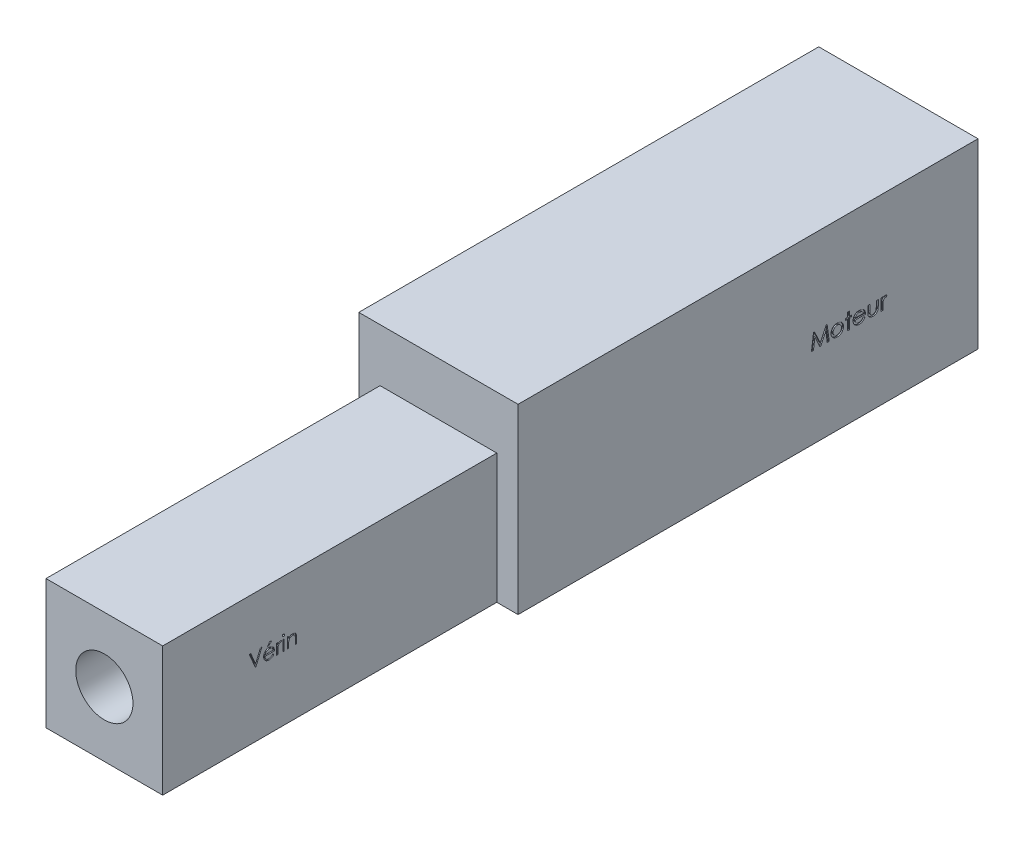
from build123d import *

# Parameters (mm, degrees)
ESQUISSE1_W      = 51
ESQUISSE1_H      = 56.5
EXTRUSION1_DEPTH = 146
ESQUISSE4_W      = 69.6
ESQUISSE4_H      = 79.6
EXTRUSION3_DEPTH = 201
EXTRUSION4_DEPTH = 0.5
EXTRUSION5_DEPTH = 0.5
ESQUISSE7_W      = 0.569871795
ESQUISSE7_H      = 4.640384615
EXTRUSION6_DEPTH = 0.5
ESQUISSE8_W      = 0.569871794
ESQUISSE8_H      = 4.640384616
EXTRUSION7_DEPTH = 0.5
ESQUISSE9_R      = 12.5
EXTRUSION8_DEPTH = 81.5
ESQUISSE11_R     = 2.5
EXTRUSION9_DEPTH = 2


with BuildPart() as part:
    # Esquisse1 → Extrusion1 (new body)
    with BuildSketch(Plane.XY):
        with Locations((0, 28.25)):
            Rectangle(ESQUISSE1_W, ESQUISSE1_H)
    extrude(amount=-EXTRUSION1_DEPTH)

    # Esquisse4 → Extrusion3 (add)
    with BuildSketch(Plane(origin=(0, 0, -146), x_dir=(-1, 0, 0), z_dir=(0, 0, -1))):
        with Locations((0, 39.8)):
            Rectangle(ESQUISSE4_W, ESQUISSE4_H)
    extrude(amount=EXTRUSION3_DEPTH)

    # Esquisse5 → Extrusion4 (cut)
    # profile 1 of 6: a face of its own
    with BuildSketch(Plane(origin=(34.8, 0, 0), x_dir=(0, 0, -1), z_dir=(1, 0, 0))):
        Polygon((274.225204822, 35.424522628), (275.144356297, 42.303689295), (275.491621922, 42.303689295), (278.100248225, 36.835633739), (280.708874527, 42.303689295), (281.061652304, 42.303689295), (281.986315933, 35.424522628), (281.111261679, 35.424522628), (280.499412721, 40.275217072), (278.266990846, 35.424522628), (277.933505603, 35.424522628), (275.707973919, 40.275217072), (275.098881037, 35.424522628), align=None)
    # profile 2 of 6: a face of its own
    with BuildSketch(Plane(origin=(34.8, 0, 0), x_dir=(0, 0, -1), z_dir=(1, 0, 0))):
        with BuildLine():
            add(Edge.make_bspline(
                [(285.472752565, 40.62799485), (285.574839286, 40.625199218), (285.774705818, 40.619725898), (286.06716325, 40.581218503), (286.344881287, 40.514313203), (286.608655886, 40.422741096), (286.857401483, 40.302768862), (287.091739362, 40.157623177), (287.310831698, 39.984481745), (287.442804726, 39.85172154), (287.509493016, 39.784635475)],
                knots=[0, 0, 0, 0, 1.078775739, 2.112039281, 3.110494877, 4.093081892, 5.057110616, 6.022958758, 7.000966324, 8, 8, 8, 8], degree=3))
            add(Edge.make_bspline(
                [(287.509493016, 39.784635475), (287.568631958, 39.718141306), (287.684903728, 39.587408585), (287.835139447, 39.3765305), (287.963083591, 39.159602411), (288.066593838, 38.934988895), (288.149098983, 38.703717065), (288.206316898, 38.464873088), (288.242348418, 38.218908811), (288.246181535, 38.052567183), (288.248121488, 37.968381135)],
                knots=[0, 0, 0, 0, 1.062178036, 2.088324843, 3.086640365, 4.066023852, 5.037709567, 6.014384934, 6.995073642, 8, 8, 8, 8], degree=3))
            add(Edge.make_bspline(
                [(288.248121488, 37.968381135), (288.245696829, 37.883730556), (288.24089149, 37.715964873), (288.203695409, 37.468139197), (288.14486913, 37.22691462), (288.060245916, 36.993392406), (287.951337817, 36.767319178), (287.820681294, 36.547319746), (287.663151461, 36.336322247), (287.486032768, 36.133714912), (287.289203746, 35.946800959), (287.074398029, 35.783159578), (286.844248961, 35.644675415), (286.599172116, 35.530683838), (286.337998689, 35.444547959), (286.063258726, 35.380758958), (285.772832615, 35.343087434), (285.574379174, 35.338617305), (285.472752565, 35.336328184)],
                knots=[0, 0, 0, 0, 0.952871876, 1.888459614, 2.815544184, 3.744891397, 4.679563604, 5.637601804, 6.621431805, 7.640342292, 8.664856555, 9.672479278, 10.67487095, 11.683873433, 12.709444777, 13.765907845, 14.855937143, 16, 16, 16, 16], degree=3))
            add(Edge.make_bspline(
                [(285.472752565, 35.336328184), (285.375694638, 35.338557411), (285.185433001, 35.342927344), (284.907402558, 35.381722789), (284.642280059, 35.440929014), (284.391998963, 35.529010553), (284.15449747, 35.639158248), (283.931364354, 35.775774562), (283.720880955, 35.935609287), (283.528537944, 36.12053886), (283.353222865, 36.319344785), (283.20105218, 36.530403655), (283.070171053, 36.748808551), (282.963766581, 36.97640686), (282.882227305, 37.213116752), (282.822524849, 37.456984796), (282.787661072, 37.710144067), (282.78262244, 37.881459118), (282.780065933, 37.968381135)],
                knots=[0, 0, 0, 0, 1.108842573, 2.173652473, 3.202745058, 4.208988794, 5.200203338, 6.189803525, 7.193715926, 8.215010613, 9.234454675, 10.219573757, 11.184848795, 12.140854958, 13.08565054, 14.042002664, 15.006549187, 16, 16, 16, 16], degree=3))
            add(Edge.make_bspline(
                [(282.780065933, 37.968381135), (282.782148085, 38.054379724), (282.786250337, 38.223813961), (282.819877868, 38.473640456), (282.876933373, 38.713687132), (282.953848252, 38.945896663), (283.055413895, 39.168500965), (283.178891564, 39.382756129), (283.323164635, 39.589453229), (283.435627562, 39.716327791), (283.492511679, 39.780501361)],
                knots=[0, 0, 0, 0, 1.034079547, 2.037341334, 3.024980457, 3.998111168, 4.974764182, 5.962233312, 6.969290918, 8, 8, 8, 8], degree=3))
            add(Edge.make_bspline(
                [(283.492511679, 39.780501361), (283.558687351, 39.848101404), (283.689148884, 39.981371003), (283.906300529, 40.154154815), (284.135406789, 40.301476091), (284.378772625, 40.419938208), (284.6335578, 40.515119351), (284.902265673, 40.580717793), (285.183594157, 40.619714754), (285.375246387, 40.625202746), (285.472752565, 40.62799485)],
                knots=[0, 0, 0, 0, 1.021997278, 2.014808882, 2.992991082, 3.961403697, 4.935644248, 5.92819495, 6.945935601, 8, 8, 8, 8], degree=3))
        make_face()
        with BuildLine():
            add(Edge.make_bspline(
                [(285.469996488, 39.83424485), (285.411112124, 39.832675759), (285.294194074, 39.829560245), (285.121983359, 39.804066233), (284.954602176, 39.762840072), (284.793887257, 39.702986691), (284.637412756, 39.62818803), (284.487808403, 39.53502322), (284.341702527, 39.427273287), (284.204414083, 39.302501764), (284.076680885, 39.166669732), (283.966010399, 39.019364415), (283.871334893, 38.864715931), (283.795513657, 38.70077223), (283.735606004, 38.528646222), (283.693687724, 38.348007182), (283.666059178, 38.158940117), (283.663378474, 38.030034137), (283.662010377, 37.96424702)],
                knots=[0, 0, 0, 0, 0.976916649, 1.939720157, 2.882730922, 3.833047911, 4.780976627, 5.756404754, 6.753607, 7.790049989, 8.831165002, 9.84360893, 10.842529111, 11.835057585, 12.835634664, 13.861933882, 14.908838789, 16, 16, 16, 16], degree=3))
            add(Edge.make_bspline(
                [(283.662010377, 37.96424702), (283.665142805, 37.878565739), (283.671307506, 37.709942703), (283.721682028, 37.462952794), (283.801629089, 37.226904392), (283.913251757, 37.004877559), (284.049707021, 36.801748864), (284.208766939, 36.623920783), (284.38434973, 36.469977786), (284.579845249, 36.346355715), (284.788550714, 36.249597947), (285.007641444, 36.180715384), (285.235882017, 36.137665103), (285.391257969, 36.132629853), (285.469996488, 36.130078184)],
                knots=[0, 0, 0, 0, 1.073737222, 2.11314337, 3.147909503, 4.191315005, 5.220292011, 6.207728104, 7.175628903, 8.139268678, 9.098074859, 10.052770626, 11.013219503, 12, 12, 12, 12], degree=3))
            add(Edge.make_bspline(
                [(285.469996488, 36.130078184), (285.555172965, 36.132988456), (285.723017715, 36.138723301), (285.968849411, 36.184303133), (286.20361814, 36.257486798), (286.42567885, 36.359483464), (286.631762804, 36.488699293), (286.816045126, 36.645522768), (286.977552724, 36.827354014), (287.115843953, 37.030033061), (287.227520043, 37.249940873), (287.307697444, 37.480733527), (287.356329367, 37.720149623), (287.362869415, 37.882259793), (287.366177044, 37.96424702)],
                knots=[0, 0, 0, 0, 1.042880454, 2.055051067, 3.051726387, 4.048830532, 5.040201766, 6.022282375, 7.002717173, 8.011000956, 9.020163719, 10.014978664, 10.996075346, 12, 12, 12, 12], degree=3))
            add(Edge.make_bspline(
                [(287.366177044, 37.96424702), (287.364739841, 38.027730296), (287.361904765, 38.15295956), (287.334845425, 38.337206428), (287.290928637, 38.514620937), (287.228522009, 38.684410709), (287.149493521, 38.847166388), (287.052258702, 39.002194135), (286.937162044, 39.150232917), (286.805954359, 39.288886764), (286.663724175, 39.416372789), (286.513439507, 39.528957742), (286.355408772, 39.622463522), (286.191822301, 39.701261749), (286.020372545, 39.759815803), (285.842821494, 39.802713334), (285.658715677, 39.830028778), (285.533482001, 39.832826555), (285.469996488, 39.83424485)],
                knots=[0, 0, 0, 0, 1.02928639, 2.030405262, 3.013559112, 3.98951401, 4.959304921, 5.943474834, 6.952548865, 7.996299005, 9.035918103, 10.047849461, 11.03697177, 12.01024899, 12.98822153, 13.969594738, 14.97071361, 16, 16, 16, 16], degree=3))
        make_face(mode=Mode.SUBTRACT)
    # profile 3 of 6: a face of its own
    with BuildSketch(Plane(origin=(34.8, 0, 0), x_dir=(0, 0, -1), z_dir=(1, 0, 0))):
        Polygon((290.012010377, 42.480078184), (290.893954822, 42.480078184), (290.893954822, 40.539800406), (291.775899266, 40.539800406), (291.775899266, 39.746050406), (290.893954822, 39.746050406), (290.893954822, 35.424522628), (290.012010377, 35.424522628), (290.012010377, 39.746050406), (289.130065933, 39.746050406), (289.130065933, 40.539800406), (290.012010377, 40.539800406), align=None)
    # profile 4 of 6: a face of its own
    with BuildSketch(Plane(origin=(34.8, 0, 0), x_dir=(0, 0, -1), z_dir=(1, 0, 0))):
        with BuildLine():
            Line((296.862238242, 37.188411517), (297.5967326, 36.837011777))
            add(Edge.make_bspline(
                [(297.5967326, 36.837011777), (297.550297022, 36.75262096), (297.459867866, 36.588277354), (297.305562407, 36.361337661), (297.138101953, 36.161756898), (296.959114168, 35.987326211), (296.766366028, 35.838086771), (296.563326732, 35.705686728), (296.345689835, 35.594669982), (296.116248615, 35.499776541), (295.871991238, 35.426752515), (295.613218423, 35.374875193), (295.339401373, 35.342559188), (295.151724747, 35.338438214), (295.055630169, 35.336328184)],
                knots=[0, 0, 0, 0, 1.110387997, 2.162381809, 3.158716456, 4.110235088, 5.03849693, 5.965639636, 6.901458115, 7.851707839, 8.825366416, 9.836184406, 10.892078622, 12, 12, 12, 12], degree=3))
            add(Edge.make_bspline(
                [(295.055630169, 35.336328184), (294.953973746, 35.338422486), (294.755402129, 35.342513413), (294.466768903, 35.382725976), (294.194416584, 35.443577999), (293.939331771, 35.531710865), (293.702499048, 35.647464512), (293.481092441, 35.785677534), (293.27771407, 35.95064555), (293.094306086, 36.139590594), (292.931384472, 36.343653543), (292.785775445, 36.554794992), (292.666677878, 36.775133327), (292.566087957, 37.000415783), (292.488657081, 37.2330721), (292.433796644, 37.472082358), (292.399345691, 37.717953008), (292.39530577, 37.884207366), (292.393260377, 37.968381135)],
                knots=[0, 0, 0, 0, 1.164566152, 2.274817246, 3.333639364, 4.359360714, 5.360157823, 6.349126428, 7.344925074, 8.35392925, 9.361228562, 10.335284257, 11.289572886, 12.22779236, 13.160187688, 14.095091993, 15.035554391, 16, 16, 16, 16], degree=3))
            add(Edge.make_bspline(
                [(292.393260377, 37.968381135), (292.395051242, 38.047025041), (292.398603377, 38.203013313), (292.4288997, 38.433385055), (292.47508482, 38.657655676), (292.54161346, 38.874908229), (292.627715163, 39.085525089), (292.732743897, 39.289799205), (292.856771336, 39.487673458), (292.952604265, 39.611760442), (293.000975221, 39.67439242)],
                knots=[0, 0, 0, 0, 1.021096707, 2.025320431, 3.012923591, 3.992437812, 4.971861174, 5.964497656, 6.972595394, 8, 8, 8, 8], degree=3))
            add(Edge.make_bspline(
                [(293.000975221, 39.67439242), (293.066387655, 39.750384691), (293.195318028, 39.900168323), (293.415040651, 40.094986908), (293.650512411, 40.260747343), (293.903284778, 40.394554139), (294.17148364, 40.50086906), (294.456640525, 40.574375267), (294.757912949, 40.61947616), (294.964058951, 40.625113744), (295.069410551, 40.62799485)],
                knots=[0, 0, 0, 0, 1.018725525, 2.007946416, 2.977291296, 3.940674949, 4.909614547, 5.904411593, 6.929042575, 8, 8, 8, 8], degree=3))
            add(Edge.make_bspline(
                [(295.069410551, 40.62799485), (295.183047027, 40.62537645), (295.404907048, 40.620264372), (295.727671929, 40.571884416), (296.032107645, 40.495465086), (296.317449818, 40.386051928), (296.584275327, 40.245747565), (296.832512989, 40.075124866), (297.062636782, 39.873182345), (297.195750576, 39.716588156), (297.263247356, 39.637185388)],
                knots=[0, 0, 0, 0, 1.092510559, 2.132980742, 3.131821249, 4.106721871, 5.065344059, 6.025034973, 6.998572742, 8, 8, 8, 8], degree=3))
            add(Edge.make_bspline(
                [(297.263247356, 39.637185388), (297.310506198, 39.575627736), (297.404721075, 39.452906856), (297.522753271, 39.25181867), (297.625409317, 39.040629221), (297.709976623, 38.816588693), (297.773567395, 38.57996457), (297.82275463, 38.332449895), (297.851117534, 38.072828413), (297.856962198, 37.89586837), (297.859937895, 37.805772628)],
                knots=[0, 0, 0, 0, 0.947891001, 1.889708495, 2.844047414, 3.816063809, 4.811874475, 5.836031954, 6.898258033, 8, 8, 8, 8], degree=3))
            Line((297.859937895, 37.805772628), (293.273826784, 37.805772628))
            add(Edge.make_bspline(
                [(293.273826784, 37.805772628), (293.276192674, 37.747308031), (293.280838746, 37.632496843), (293.310115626, 37.464821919), (293.35073935, 37.303976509), (293.407667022, 37.150210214), (293.479734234, 37.003425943), (293.566655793, 36.863719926), (293.669746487, 36.732153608), (293.786103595, 36.609095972), (293.913059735, 36.497133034), (294.04719451, 36.398762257), (294.187497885, 36.314697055), (294.334846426, 36.247980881), (294.487823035, 36.194442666), (294.646899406, 36.158292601), (294.8118328, 36.133057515), (294.924158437, 36.131081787), (294.981216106, 36.130078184)],
                knots=[0, 0, 0, 0, 1.056285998, 2.074305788, 3.068874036, 4.051103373, 5.031155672, 6.019259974, 7.018838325, 8.046424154, 9.075617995, 10.073437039, 11.048590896, 12.025474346, 12.991505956, 13.972050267, 14.969869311, 16, 16, 16, 16], degree=3))
            add(Edge.make_bspline(
                [(294.981216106, 36.130078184), (295.042388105, 36.13122841), (295.164217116, 36.133519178), (295.344586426, 36.157291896), (295.522375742, 36.190612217), (295.694588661, 36.24110587), (295.859921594, 36.300209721), (296.013210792, 36.370756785), (296.153111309, 36.449215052), (296.284984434, 36.539979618), (296.416363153, 36.653778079), (296.554773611, 36.800112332), (296.705804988, 36.981473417), (296.807715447, 37.116285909), (296.862238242, 37.188411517)],
                knots=[0, 0, 0, 0, 0.974501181, 1.940798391, 2.895710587, 3.855187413, 4.797895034, 5.692306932, 6.541458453, 7.351844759, 8.239729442, 9.306468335, 10.558942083, 12, 12, 12, 12], degree=3))
        make_face()
        with BuildLine():
            add(Edge.make_bspline(
                [(296.979371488, 38.599522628), (296.957023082, 38.65649629), (296.912450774, 38.770126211), (296.826637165, 38.931435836), (296.725029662, 39.082081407), (296.610470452, 39.22436004), (296.477115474, 39.355263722), (296.322812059, 39.472089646), (296.149261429, 39.578019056), (295.956413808, 39.666845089), (295.75188807, 39.74095258), (295.539742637, 39.79526222), (295.322133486, 39.827647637), (295.175167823, 39.832034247), (295.101105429, 39.83424485)],
                knots=[0, 0, 0, 0, 0.917468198, 1.829825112, 2.733739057, 3.639830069, 4.565591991, 5.528900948, 6.536885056, 7.609579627, 8.708054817, 9.795976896, 10.889296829, 12, 12, 12, 12], degree=3))
            add(Edge.make_bspline(
                [(295.101105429, 39.83424485), (295.044555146, 39.832818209), (294.932505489, 39.82999144), (294.766926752, 39.810567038), (294.606406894, 39.777573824), (294.451020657, 39.730341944), (294.300884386, 39.669515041), (294.15514562, 39.595958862), (294.01435016, 39.509460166), (293.926020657, 39.442266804), (293.881541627, 39.408431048)],
                knots=[0, 0, 0, 0, 1.030056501, 2.040970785, 3.032161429, 4.011555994, 4.995123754, 5.979296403, 6.982458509, 8, 8, 8, 8], degree=3))
            add(Edge.make_bspline(
                [(293.881541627, 39.408431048), (293.825063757, 39.358714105), (293.709478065, 39.256965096), (293.565990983, 39.065973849), (293.436909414, 38.847003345), (293.372225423, 38.684179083), (293.338594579, 38.599522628)],
                knots=[0, 0, 0, 0, 0.913853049, 1.870260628, 2.892694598, 4, 4, 4, 4], degree=3))
            Line((293.338594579, 38.599522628), (296.979371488, 38.599522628))
        make_face(mode=Mode.SUBTRACT)
    # profile 5 of 6: a face of its own
    with BuildSketch(Plane(origin=(34.8, 0, 0), x_dir=(0, 0, -1), z_dir=(1, 0, 0))):
        with BuildLine():
            Line((298.831454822, 40.539800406), (299.713399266, 40.539800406))
            Line((299.713399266, 40.539800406), (299.713399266, 38.165440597))
            add(Edge.make_bspline(
                [(299.713399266, 38.165440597), (299.713658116, 38.098374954), (299.714154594, 37.969741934), (299.718045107, 37.785039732), (299.725469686, 37.61787252), (299.732369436, 37.467921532), (299.74582092, 37.335747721), (299.758096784, 37.220060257), (299.775959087, 37.122141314), (299.790761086, 37.063406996), (299.797459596, 37.036827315)],
                knots=[0, 0, 0, 0, 1.418944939, 2.721560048, 3.90822129, 4.959445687, 5.896519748, 6.718644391, 7.420134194, 8, 8, 8, 8], degree=3))
            add(Edge.make_bspline(
                [(299.797459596, 37.036827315), (299.822642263, 36.965486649), (299.871318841, 36.82758944), (299.982147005, 36.642207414), (300.115918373, 36.482661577), (300.277213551, 36.354037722), (300.457129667, 36.252132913), (300.655429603, 36.183536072), (300.867369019, 36.13637542), (301.014452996, 36.132216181), (301.090059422, 36.130078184)],
                knots=[0, 0, 0, 0, 1.064698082, 2.057997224, 3.027713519, 3.985869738, 4.951769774, 5.929245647, 6.93555818, 8, 8, 8, 8], degree=3))
            add(Edge.make_bspline(
                [(301.090059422, 36.130078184), (301.172498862, 36.132866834), (301.331748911, 36.13825373), (301.560745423, 36.183130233), (301.770297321, 36.256938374), (301.956601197, 36.363506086), (302.121690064, 36.490259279), (302.257236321, 36.640455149), (302.3706204, 36.805544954), (302.418942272, 36.929092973), (302.443292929, 36.991352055)],
                knots=[0, 0, 0, 0, 1.152522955, 2.226353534, 3.250900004, 4.246517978, 5.217118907, 6.149589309, 7.067529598, 8, 8, 8, 8], degree=3))
            add(Edge.make_bspline(
                [(302.443292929, 36.991352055), (302.451188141, 37.017406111), (302.468709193, 37.075225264), (302.484348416, 37.17396526), (302.502033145, 37.290871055), (302.512755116, 37.428126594), (302.524783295, 37.584658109), (302.530621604, 37.76118303), (302.534984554, 37.956873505), (302.535402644, 38.093778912), (302.535621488, 38.165440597)],
                knots=[0, 0, 0, 0, 0.552623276, 1.226381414, 2.027670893, 2.955584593, 4.022320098, 5.218031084, 6.543807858, 8, 8, 8, 8], degree=3))
            Line((302.535621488, 38.165440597), (302.535621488, 40.539800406))
            Line((302.535621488, 40.539800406), (303.417565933, 40.539800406))
            Line((303.417565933, 40.539800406), (303.417565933, 38.045551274))
            add(Edge.make_bspline(
                [(303.417565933, 38.045551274), (303.416661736, 37.963779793), (303.414903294, 37.804754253), (303.404540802, 37.573915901), (303.384541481, 37.357986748), (303.36027542, 37.157030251), (303.322795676, 36.971752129), (303.283254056, 36.800841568), (303.233232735, 36.645165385), (303.175061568, 36.50328173), (303.108330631, 36.372577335), (303.033018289, 36.250488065), (302.950177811, 36.134074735), (302.858387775, 36.02404554), (302.756520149, 35.921866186), (302.647791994, 35.824617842), (302.52887406, 35.735481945), (302.402119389, 35.652582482), (302.266646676, 35.577487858), (302.121986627, 35.513576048), (301.969939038, 35.457515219), (301.80868602, 35.41431209), (301.639624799, 35.37786061), (301.461814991, 35.35348785), (301.275845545, 35.340024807), (301.149336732, 35.337580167), (301.08454727, 35.336328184)],
                knots=[0, 0, 0, 0, 1.433126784, 2.78708125, 4.047948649, 5.23317835, 6.332013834, 7.359028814, 8.306074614, 9.194073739, 10.043734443, 10.874888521, 11.705886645, 12.545920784, 13.382708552, 14.23240739, 15.100217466, 15.98441358, 16.885165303, 17.811245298, 18.753488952, 19.72218431, 20.734230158, 21.782757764, 22.864474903, 24, 24, 24, 24], degree=3))
            add(Edge.make_bspline(
                [(301.08454727, 35.336328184), (301.023414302, 35.336823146), (300.903702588, 35.337792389), (300.728516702, 35.354139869), (300.56046776, 35.377023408), (300.399718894, 35.409852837), (300.246286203, 35.452438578), (300.100767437, 35.505094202), (299.962511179, 35.56717605), (299.831720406, 35.63872222), (299.709107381, 35.718949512), (299.593873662, 35.805786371), (299.487767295, 35.901134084), (299.38982283, 36.003887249), (299.297842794, 36.112213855), (299.217202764, 36.230559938), (299.142373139, 36.354405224), (299.075067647, 36.487105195), (299.016570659, 36.632175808), (298.967812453, 36.792897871), (298.925036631, 36.969040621), (298.891195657, 37.161991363), (298.863696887, 37.370692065), (298.844679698, 37.596470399), (298.834048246, 37.838282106), (298.832336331, 38.005118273), (298.831454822, 38.091026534)],
                knots=[0, 0, 0, 0, 1.07579807, 2.106647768, 3.094742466, 4.060581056, 4.992547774, 5.895540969, 6.78231141, 7.658099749, 8.517151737, 9.359794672, 10.195893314, 11.025198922, 11.857652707, 12.69437682, 13.543128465, 14.403853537, 15.310857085, 16.293043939, 17.358059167, 18.500139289, 19.739904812, 21.062881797, 22.487601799, 24, 24, 24, 24], degree=3))
            Line((298.831454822, 38.091026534), (298.831454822, 40.539800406))
        make_face()
    # profile 6 of 6: a face of its own
    with BuildSketch(Plane(origin=(34.8, 0, 0), x_dir=(0, 0, -1), z_dir=(1, 0, 0))):
        with BuildLine():
            Line((304.564093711, 40.539800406), (305.446038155, 40.539800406))
            Line((305.446038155, 40.539800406), (305.446038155, 39.813574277))
            add(Edge.make_bspline(
                [(305.446038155, 39.813574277), (305.451359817, 39.846777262), (305.461746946, 39.91158478), (305.487947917, 40.004716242), (305.524187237, 40.091181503), (305.569737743, 40.171078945), (305.623757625, 40.244712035), (305.686795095, 40.311620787), (305.758556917, 40.372742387), (305.867126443, 40.442603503), (306.009671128, 40.516494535), (306.188526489, 40.580620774), (306.371626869, 40.62124494), (306.495896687, 40.625742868), (306.558114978, 40.62799485)],
                knots=[0, 0, 0, 0, 0.801625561, 1.56465941, 2.301277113, 3.032414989, 3.753384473, 4.4742707, 5.220602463, 5.995500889, 7.548895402, 9.039144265, 10.517585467, 12, 12, 12, 12], degree=3))
            add(Edge.make_bspline(
                [(306.558114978, 40.62799485), (306.614388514, 40.624653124), (306.73261227, 40.61763257), (306.914209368, 40.570824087), (307.105430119, 40.493569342), (307.231734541, 40.424512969), (307.298121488, 40.388216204)],
                knots=[0, 0, 0, 0, 0.858860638, 1.804360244, 2.845948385, 4, 4, 4, 4], degree=3))
            Line((307.298121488, 40.388216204), (306.880575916, 39.747428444))
            add(Edge.make_bspline(
                [(306.880575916, 39.747428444), (306.832947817, 39.760901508), (306.74594016, 39.785514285), (306.626008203, 39.810588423), (306.5311178, 39.829591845), (306.475487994, 39.832863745), (306.452006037, 39.83424485)],
                knots=[0, 0, 0, 0, 1.354987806, 2.475310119, 3.356411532, 4, 4, 4, 4], degree=3))
            add(Edge.make_bspline(
                [(306.452006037, 39.83424485), (306.413529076, 39.831423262), (306.332544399, 39.825484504), (306.211738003, 39.778807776), (306.08770308, 39.706792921), (305.98551433, 39.626157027), (305.90353422, 39.547339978), (305.844881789, 39.475042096), (305.787957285, 39.393219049), (305.734518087, 39.301042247), (305.68520073, 39.198434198), (305.638560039, 39.086578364), (305.593757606, 38.965052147), (305.569055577, 38.879440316), (305.556281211, 38.835167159)],
                knots=[0, 0, 0, 0, 0.965356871, 2.031842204, 3.216327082, 4.56533618, 5.292082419, 6.07124699, 6.900886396, 7.796081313, 8.746333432, 9.760722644, 10.841983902, 12, 12, 12, 12], degree=3))
            add(Edge.make_bspline(
                [(305.556281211, 38.835167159), (305.546953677, 38.798541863), (305.526025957, 38.716367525), (305.506323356, 38.576868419), (305.486486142, 38.410177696), (305.472531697, 38.215628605), (305.45967039, 37.993776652), (305.452354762, 37.743796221), (305.446288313, 37.465886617), (305.446124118, 37.271098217), (305.446038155, 37.169118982)],
                knots=[0, 0, 0, 0, 0.541796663, 1.215601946, 2.018210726, 2.950106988, 4.012619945, 5.205915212, 6.537188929, 8, 8, 8, 8], degree=3))
            Line((305.446038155, 37.169118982), (305.446038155, 35.424522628))
            Line((305.446038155, 35.424522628), (304.564093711, 35.424522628))
            Line((304.564093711, 35.424522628), (304.564093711, 40.539800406))
        make_face()
    extrude(amount=-EXTRUSION4_DEPTH, mode=Mode.SUBTRACT)

    # Esquisse6 → Extrusion5 (cut)
    # profile 1 of 6: a face of its own
    with BuildSketch(Plane.ZY.offset(34.8)):
        Polygon((-310.246723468, 36.488036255), (-309.408452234, 42.838036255), (-309.327041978, 42.838036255), (-306.705377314, 37.627779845), (-304.090072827, 42.838036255), (-304.007390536, 42.838036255), (-303.164031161, 36.488036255), (-303.736447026, 36.488036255), (-304.344479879, 41.057186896), (-306.636687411, 36.488036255), (-306.765162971, 36.488036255), (-309.06627475, 41.067363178), (-309.673035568, 36.488036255), align=None)
    # profile 2 of 6: a face of its own
    with BuildSketch(Plane.ZY.offset(34.8)):
        with BuildLine():
            add(Edge.make_bspline(
                [(-299.782961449, 41.209831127), (-299.695891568, 41.207977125), (-299.525168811, 41.204341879), (-299.275145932, 41.165489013), (-299.036485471, 41.106075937), (-298.80827338, 41.023940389), (-298.593432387, 40.913845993), (-298.38883313, 40.78247485), (-298.195036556, 40.626840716), (-298.078880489, 40.506448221), (-298.019920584, 40.445337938)],
                knots=[0, 0, 0, 0, 1.054011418, 2.066658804, 3.057071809, 4.030435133, 4.997543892, 5.974964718, 6.972108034, 8, 8, 8, 8], degree=3))
            add(Edge.make_bspline(
                [(-298.019920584, 40.445337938), (-297.969153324, 40.386892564), (-297.868601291, 40.271132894), (-297.739667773, 40.083434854), (-297.628594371, 39.8890521), (-297.539580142, 39.685403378), (-297.469394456, 39.474266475), (-297.419563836, 39.254915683), (-297.389923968, 39.027835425), (-297.385927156, 38.873614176), (-297.383902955, 38.79550821)],
                knots=[0, 0, 0, 0, 1.025258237, 2.030674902, 3.01204498, 3.988269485, 4.97094183, 5.956517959, 6.965070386, 8, 8, 8, 8], degree=3))
            add(Edge.make_bspline(
                [(-297.383902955, 38.79550821), (-297.385683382, 38.716949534), (-297.389201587, 38.561713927), (-297.422482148, 38.333078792), (-297.47424569, 38.11138247), (-297.54832631, 37.897553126), (-297.64331888, 37.690937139), (-297.759234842, 37.492436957), (-297.896887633, 37.301660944), (-298.052923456, 37.120229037), (-298.225374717, 36.95301319), (-298.412456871, 36.807274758), (-298.610493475, 36.68241285), (-298.822117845, 36.581835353), (-299.045397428, 36.502533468), (-299.280813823, 36.446834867), (-299.528001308, 36.413158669), (-299.696779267, 36.408834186), (-299.782961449, 36.406625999)],
                knots=[0, 0, 0, 0, 0.998656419, 1.973391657, 2.932242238, 3.890759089, 4.846373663, 5.82037756, 6.809684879, 7.83454468, 8.860553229, 9.859544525, 10.845671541, 11.83227036, 12.833544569, 13.85385346, 14.904124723, 16, 16, 16, 16], degree=3))
            add(Edge.make_bspline(
                [(-299.782961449, 36.406625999), (-299.869565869, 36.408841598), (-300.039185, 36.41318096), (-300.287244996, 36.44670403), (-300.523083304, 36.502507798), (-300.74665519, 36.582095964), (-300.959189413, 36.682416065), (-301.158373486, 36.806897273), (-301.345607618, 36.953056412), (-301.518095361, 37.120217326), (-301.674121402, 37.301663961), (-301.811776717, 37.492436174), (-301.927692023, 37.690937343), (-302.022684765, 37.897553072), (-302.09676534, 38.111382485), (-302.148528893, 38.333078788), (-302.181809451, 38.561713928), (-302.185327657, 38.716949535), (-302.187108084, 38.79550821)],
                knots=[0, 0, 0, 0, 1.099876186, 2.154163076, 3.173186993, 4.173200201, 5.163417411, 6.152872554, 7.150605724, 8.17532212, 9.198891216, 10.186952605, 11.159729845, 12.11414092, 13.071450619, 14.029093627, 15.002601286, 16, 16, 16, 16], degree=3))
            add(Edge.make_bspline(
                [(-302.187108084, 38.79550821), (-302.185070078, 38.873189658), (-302.181035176, 39.026985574), (-302.15142511, 39.253638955), (-302.101788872, 39.472618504), (-302.031519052, 39.682940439), (-301.941684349, 39.88569673), (-301.832171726, 40.080559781), (-301.701923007, 40.267409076), (-301.601770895, 40.383019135), (-301.551090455, 40.441521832)],
                knots=[0, 0, 0, 0, 1.031353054, 2.041901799, 3.029428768, 4.008703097, 4.981709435, 5.96992636, 6.972712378, 8, 8, 8, 8], degree=3))
            add(Edge.make_bspline(
                [(-301.551090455, 40.441521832), (-301.49221944, 40.503162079), (-301.37643923, 40.624388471), (-301.181677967, 40.779568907), (-300.977582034, 40.913673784), (-300.760366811, 41.021580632), (-300.532342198, 41.106559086), (-300.292458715, 41.165642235), (-300.041587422, 41.204201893), (-299.870029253, 41.207936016), (-299.782961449, 41.209831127)],
                knots=[0, 0, 0, 0, 1.027980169, 2.021703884, 2.998553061, 3.971491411, 4.943284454, 5.930300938, 6.949603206, 8, 8, 8, 8], degree=3))
        make_face()
        with BuildLine():
            add(Edge.make_bspline(
                [(-299.78550552, 40.639959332), (-299.847078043, 40.638209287), (-299.968633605, 40.634754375), (-300.147557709, 40.608476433), (-300.319806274, 40.566843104), (-300.485706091, 40.507690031), (-300.644697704, 40.4313106), (-300.796933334, 40.337496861), (-300.94286076, 40.227491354), (-301.079625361, 40.101466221), (-301.205141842, 39.963800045), (-301.314866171, 39.817118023), (-301.408166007, 39.663799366), (-301.485890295, 39.50368464), (-301.54377905, 39.335151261), (-301.585821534, 39.16010783), (-301.612074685, 38.978197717), (-301.615497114, 38.854534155), (-301.617236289, 38.791692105)],
                knots=[0, 0, 0, 0, 1.021534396, 2.016698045, 2.994645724, 3.958388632, 4.93408049, 5.916473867, 6.921342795, 7.962252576, 8.998418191, 10.008913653, 10.997312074, 11.973003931, 12.956656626, 13.948281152, 14.957379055, 16, 16, 16, 16], degree=3))
            add(Edge.make_bspline(
                [(-301.617236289, 38.791692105), (-301.614321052, 38.710499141), (-301.608534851, 38.549346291), (-301.561480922, 38.31201754), (-301.482765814, 38.08417618), (-301.37647175, 37.867157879), (-301.243291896, 37.666366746), (-301.086379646, 37.487348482), (-300.907419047, 37.332797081), (-300.708543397, 37.204561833), (-300.493814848, 37.10267199), (-300.266564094, 37.030465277), (-300.029544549, 36.983526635), (-299.867563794, 36.978861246), (-299.78550552, 36.976497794)],
                knots=[0, 0, 0, 0, 1.016792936, 2.018143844, 3.017858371, 4.030088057, 5.03801393, 6.028138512, 7.003788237, 7.991172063, 8.984598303, 9.972568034, 10.972917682, 12, 12, 12, 12], degree=3))
            add(Edge.make_bspline(
                [(-299.78550552, 36.976497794), (-299.703451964, 36.978875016), (-299.541480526, 36.983567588), (-299.304790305, 37.030228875), (-299.078160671, 37.102988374), (-298.863655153, 37.204447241), (-298.66487003, 37.33328405), (-298.484622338, 37.486475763), (-298.329049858, 37.666840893), (-298.196001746, 37.867423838), (-298.087966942, 38.083839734), (-298.009620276, 38.312059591), (-297.962453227, 38.549335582), (-297.956682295, 38.710495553), (-297.95377475, 38.791692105)],
                knots=[0, 0, 0, 0, 1.02726834, 2.027799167, 3.010890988, 4.004497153, 4.992059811, 5.971914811, 6.958719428, 7.966827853, 8.981595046, 9.981490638, 10.983022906, 12, 12, 12, 12], degree=3))
            add(Edge.make_bspline(
                [(-297.95377475, 38.791692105), (-297.955513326, 38.854534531), (-297.958934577, 38.978198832), (-297.985196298, 39.160103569), (-298.027207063, 39.335166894), (-298.085212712, 39.503626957), (-298.16259928, 39.664213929), (-298.257698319, 39.816667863), (-298.366974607, 39.964308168), (-298.49400567, 40.101021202), (-298.630627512, 40.227540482), (-298.776614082, 40.337539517), (-298.928623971, 40.430898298), (-299.087153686, 40.508343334), (-299.253074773, 40.566304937), (-299.425081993, 40.608716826), (-299.603242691, 40.634643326), (-299.724362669, 40.638175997), (-299.78550552, 40.639959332)],
                knots=[0, 0, 0, 0, 1.042956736, 2.052379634, 3.044323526, 4.02829302, 5.004299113, 5.996692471, 7.007513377, 8.048758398, 9.090003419, 10.095195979, 11.07790575, 12.047570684, 13.018257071, 13.989683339, 14.985167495, 16, 16, 16, 16], degree=3))
        make_face(mode=Mode.SUBTRACT)
    # profile 3 of 6: a face of its own
    with BuildSketch(Plane.ZY.offset(34.8)):
        Polygon((-295.674287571, 43.000856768), (-295.104415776, 43.000856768), (-295.104415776, 41.128420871), (-294.290313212, 41.128420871), (-294.290313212, 40.558549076), (-295.104415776, 40.558549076), (-295.104415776, 36.488036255), (-295.674287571, 36.488036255), (-295.674287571, 40.558549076), (-296.488390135, 40.558549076), (-296.488390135, 41.128420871), (-295.674287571, 41.128420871), align=None)
    # profile 4 of 6: a face of its own
    with BuildSketch(Plane.ZY.offset(34.8)):
        with BuildLine():
            Line((-289.504916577, 37.953420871), (-288.998646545, 37.687565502))
            add(Edge.make_bspline(
                [(-288.998646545, 37.687565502), (-289.038990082, 37.61600403), (-289.117482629, 37.476773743), (-289.252466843, 37.285490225), (-289.393966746, 37.113409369), (-289.54836966, 36.965128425), (-289.711056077, 36.835858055), (-289.882928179, 36.72275943), (-290.064880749, 36.626387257), (-290.256922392, 36.545193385), (-290.460665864, 36.482764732), (-290.6766049, 36.438669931), (-290.905153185, 36.411413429), (-291.061809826, 36.408247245), (-291.142025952, 36.406625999)],
                knots=[0, 0, 0, 0, 1.120438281, 2.179929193, 3.190490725, 4.156257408, 5.095198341, 6.022838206, 6.959905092, 7.901321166, 8.864066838, 9.862729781, 10.905609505, 12, 12, 12, 12], degree=3))
            add(Edge.make_bspline(
                [(-291.142025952, 36.406625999), (-291.23118354, 36.408707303), (-291.405104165, 36.412767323), (-291.658269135, 36.447769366), (-291.896628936, 36.504869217), (-292.12017017, 36.584635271), (-292.328345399, 36.688824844), (-292.521568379, 36.815751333), (-292.700855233, 36.964762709), (-292.860556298, 37.137149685), (-293.004327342, 37.321629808), (-293.131192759, 37.513864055), (-293.237251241, 37.713368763), (-293.323525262, 37.918873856), (-293.39320266, 38.129084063), (-293.441765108, 38.345912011), (-293.46975908, 38.568770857), (-293.474048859, 38.719533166), (-293.476210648, 38.79550821)],
                knots=[0, 0, 0, 0, 1.145258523, 2.234067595, 3.276747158, 4.290159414, 5.277019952, 6.260822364, 7.254936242, 8.264827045, 9.274100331, 10.257902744, 11.220704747, 12.172965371, 13.118907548, 14.062713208, 15.023725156, 16, 16, 16, 16], degree=3))
            add(Edge.make_bspline(
                [(-293.476210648, 38.79550821), (-293.474289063, 38.86680026), (-293.470480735, 39.008091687), (-293.446476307, 39.217216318), (-293.403934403, 39.420467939), (-293.345557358, 39.618015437), (-293.270171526, 39.809528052), (-293.177947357, 39.995122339), (-293.068741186, 40.174600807), (-292.984426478, 40.287817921), (-292.94195584, 40.344847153)],
                knots=[0, 0, 0, 0, 1.024358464, 2.0301432, 3.019427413, 4.004406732, 4.986367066, 5.972626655, 6.978780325, 8, 8, 8, 8], degree=3))
            add(Edge.make_bspline(
                [(-292.94195584, 40.344847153), (-292.884429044, 40.413552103), (-292.771197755, 40.548785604), (-292.579688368, 40.72647371), (-292.372315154, 40.875324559), (-292.151676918, 40.998708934), (-291.915209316, 41.092459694), (-291.66609103, 41.16232345), (-291.401485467, 41.201472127), (-291.220591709, 41.207001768), (-291.128033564, 41.209831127)],
                knots=[0, 0, 0, 0, 1.030682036, 2.02871468, 2.997146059, 3.962720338, 4.930598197, 5.918074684, 6.934738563, 8, 8, 8, 8], degree=3))
            add(Edge.make_bspline(
                [(-291.128033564, 41.209831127), (-291.032878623, 41.207374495), (-290.84620632, 41.202555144), (-290.574005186, 41.157875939), (-290.316447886, 41.087023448), (-290.073637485, 40.986958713), (-289.845549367, 40.857854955), (-289.633666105, 40.697940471), (-289.434364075, 40.512124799), (-289.318415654, 40.369225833), (-289.259413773, 40.296509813)],
                knots=[0, 0, 0, 0, 1.056321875, 2.072262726, 3.055038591, 4.01806755, 4.982017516, 5.957941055, 6.960871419, 8, 8, 8, 8], degree=3))
            add(Edge.make_bspline(
                [(-289.259413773, 40.296509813), (-289.219269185, 40.241711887), (-289.139247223, 40.132480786), (-289.039013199, 39.954370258), (-288.952004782, 39.768023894), (-288.882457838, 39.570429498), (-288.826143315, 39.363928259), (-288.785400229, 39.147043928), (-288.761506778, 38.919841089), (-288.756810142, 38.765034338), (-288.754415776, 38.686113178)],
                knots=[0, 0, 0, 0, 0.94817472, 1.890038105, 2.849395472, 3.817997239, 4.812318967, 5.836947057, 6.897266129, 8, 8, 8, 8], degree=3))
            Line((-288.754415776, 38.686113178), (-292.906338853, 38.686113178))
            add(Edge.make_bspline(
                [(-292.906338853, 38.686113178), (-292.903545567, 38.624970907), (-292.898052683, 38.504737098), (-292.87244378, 38.328804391), (-292.832078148, 38.161212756), (-292.775347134, 38.003219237), (-292.706645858, 37.852760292), (-292.622488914, 37.710952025), (-292.522087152, 37.578440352), (-292.410099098, 37.454039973), (-292.285444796, 37.343258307), (-292.15430324, 37.24410437), (-292.014796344, 37.16099993), (-291.868024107, 37.093544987), (-291.714223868, 37.040737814), (-291.553347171, 37.00469191), (-291.385710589, 36.980549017), (-291.271436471, 36.977864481), (-291.213259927, 36.976497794)],
                knots=[0, 0, 0, 0, 1.094153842, 2.151609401, 3.174256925, 4.172055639, 5.149267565, 6.128595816, 7.11444997, 8.118368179, 9.117203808, 10.09244225, 11.054858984, 12.015122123, 12.976791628, 13.957293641, 14.960065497, 16, 16, 16, 16], degree=3))
            add(Edge.make_bspline(
                [(-291.213259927, 36.976497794), (-291.156379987, 36.977600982), (-291.043519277, 36.97978992), (-290.875442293, 37.001074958), (-290.71008915, 37.035492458), (-290.548144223, 37.082464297), (-290.39289426, 37.139753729), (-290.249120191, 37.208883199), (-290.116894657, 37.285354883), (-289.993311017, 37.372821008), (-289.873439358, 37.479878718), (-289.754526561, 37.613474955), (-289.627024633, 37.771476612), (-289.547214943, 37.890395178), (-289.504916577, 37.953420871)],
                knots=[0, 0, 0, 0, 0.99110716, 1.966546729, 2.947904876, 3.932708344, 4.903319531, 5.828989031, 6.710028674, 7.56322171, 8.463672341, 9.504779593, 10.677557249, 12, 12, 12, 12], degree=3))
        make_face()
        with BuildLine():
            add(Edge.make_bspline(
                [(-289.324287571, 39.255984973), (-289.345145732, 39.33157333), (-289.385290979, 39.477056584), (-289.469176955, 39.678516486), (-289.563649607, 39.857564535), (-289.675449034, 40.01283044), (-289.802120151, 40.150722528), (-289.948433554, 40.271224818), (-290.112510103, 40.379025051), (-290.293501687, 40.470016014), (-290.485166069, 40.547467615), (-290.685837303, 40.599401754), (-290.890593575, 40.634979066), (-291.02908578, 40.638292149), (-291.098776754, 40.639959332)],
                knots=[0, 0, 0, 0, 1.154881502, 2.222775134, 3.210006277, 4.132804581, 5.035138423, 5.962687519, 6.919655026, 7.923214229, 8.944639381, 9.960483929, 10.97369054, 12, 12, 12, 12], degree=3))
            add(Edge.make_bspline(
                [(-291.098776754, 40.639959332), (-291.155653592, 40.638849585), (-291.268087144, 40.636655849), (-291.433733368, 40.615845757), (-291.592809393, 40.581447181), (-291.746488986, 40.534339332), (-291.892758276, 40.471549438), (-292.034625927, 40.39791987), (-292.168484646, 40.308037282), (-292.252198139, 40.239531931), (-292.294489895, 40.204923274)],
                knots=[0, 0, 0, 0, 1.04873581, 2.073130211, 3.073294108, 4.04793562, 5.032784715, 6.005352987, 6.992311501, 8, 8, 8, 8], degree=3))
            add(Edge.make_bspline(
                [(-292.294489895, 40.204923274), (-292.324776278, 40.177537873), (-292.386068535, 40.122116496), (-292.467966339, 40.026632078), (-292.546380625, 39.923668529), (-292.617743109, 39.809286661), (-292.683198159, 39.684788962), (-292.744448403, 39.551225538), (-292.799578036, 39.407582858), (-292.830595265, 39.30748429), (-292.846553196, 39.255984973)],
                knots=[0, 0, 0, 0, 0.879870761, 1.780643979, 2.707998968, 3.669668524, 4.684282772, 5.740141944, 6.837334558, 8, 8, 8, 8], degree=3))
            Line((-292.846553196, 39.255984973), (-289.324287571, 39.255984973))
        make_face(mode=Mode.SUBTRACT)
    # profile 5 of 6: a face of its own
    with BuildSketch(Plane.ZY.offset(34.8)):
        with BuildLine():
            Line((-287.696082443, 41.128420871), (-287.126210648, 41.128420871))
            Line((-287.126210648, 41.128420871), (-287.126210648, 38.976137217))
            add(Edge.make_bspline(
                [(-287.126210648, 38.976137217), (-287.125953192, 38.9129588), (-287.12546069, 38.792101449), (-287.122120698, 38.618192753), (-287.114264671, 38.45959386), (-287.104442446, 38.316213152), (-287.091811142, 38.188074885), (-287.076782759, 38.075626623), (-287.059985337, 37.977593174), (-287.043542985, 37.918550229), (-287.035896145, 37.891091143)],
                knots=[0, 0, 0, 0, 1.388932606, 2.656963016, 3.823490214, 4.879454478, 5.816252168, 6.653371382, 7.373723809, 8, 8, 8, 8], degree=3))
            add(Edge.make_bspline(
                [(-287.035896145, 37.891091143), (-287.023628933, 37.85657822), (-286.999349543, 37.788269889), (-286.955310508, 37.689592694), (-286.900830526, 37.598197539), (-286.84121341, 37.51056015), (-286.772453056, 37.429276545), (-286.695419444, 37.354483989), (-286.612691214, 37.283356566), (-286.489764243, 37.199201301), (-286.321653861, 37.109003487), (-286.100941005, 37.031178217), (-285.861629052, 36.984667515), (-285.696230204, 36.979271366), (-285.611216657, 36.976497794)],
                knots=[0, 0, 0, 0, 0.725840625, 1.436591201, 2.137033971, 2.831655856, 3.53531722, 4.242432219, 4.957935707, 5.694543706, 7.190802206, 8.724350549, 10.316345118, 12, 12, 12, 12], degree=3))
            add(Edge.make_bspline(
                [(-285.611216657, 36.976497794), (-285.526211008, 36.979330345), (-285.361740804, 36.984810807), (-285.125058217, 37.029775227), (-284.908702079, 37.104896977), (-284.714843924, 37.209776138), (-284.544363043, 37.338122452), (-284.402296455, 37.488724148), (-284.285080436, 37.656816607), (-284.233900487, 37.782227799), (-284.20816177, 37.845297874)],
                knots=[0, 0, 0, 0, 1.157059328, 2.238695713, 3.266970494, 4.264342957, 5.228770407, 6.160125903, 7.074715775, 8, 8, 8, 8], degree=3))
            add(Edge.make_bspline(
                [(-284.20816177, 37.845297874), (-284.200552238, 37.87063673), (-284.183729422, 37.926654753), (-284.16565487, 38.021686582), (-284.149372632, 38.135015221), (-284.135469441, 38.267382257), (-284.125554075, 38.418441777), (-284.120209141, 38.588146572), (-284.114170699, 38.775963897), (-284.114079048, 38.907441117), (-284.114031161, 38.976137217)],
                knots=[0, 0, 0, 0, 0.557542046, 1.232589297, 2.036731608, 2.971723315, 4.038036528, 5.22795436, 6.551621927, 8, 8, 8, 8], degree=3))
            Line((-284.114031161, 38.976137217), (-284.114031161, 41.128420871))
            Line((-284.114031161, 41.128420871), (-283.544159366, 41.128420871))
            Line((-283.544159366, 41.128420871), (-283.544159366, 38.869286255))
            add(Edge.make_bspline(
                [(-283.544159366, 38.869286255), (-283.544960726, 38.792528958), (-283.546515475, 38.643609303), (-283.55650737, 38.427193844), (-283.573651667, 38.225513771), (-283.599673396, 38.038462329), (-283.630272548, 37.866182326), (-283.669744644, 37.70845296), (-283.716876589, 37.565760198), (-283.770045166, 37.435600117), (-283.832859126, 37.317586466), (-283.899673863, 37.205580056), (-283.976825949, 37.102360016), (-284.058051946, 37.002788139), (-284.148406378, 36.911817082), (-284.246196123, 36.827359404), (-284.350044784, 36.748124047), (-284.462256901, 36.677201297), (-284.581194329, 36.613308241), (-284.707003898, 36.556673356), (-284.841226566, 36.511855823), (-284.982130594, 36.473192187), (-285.130406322, 36.442867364), (-285.285910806, 36.421483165), (-285.448591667, 36.40837435), (-285.559461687, 36.407218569), (-285.616304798, 36.406625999)],
                knots=[0, 0, 0, 0, 1.493040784, 2.896703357, 4.213163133, 5.428574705, 6.569057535, 7.615249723, 8.588095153, 9.490268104, 10.346124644, 11.18633936, 12.024365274, 12.850166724, 13.684164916, 14.514361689, 15.362232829, 16.222528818, 17.093394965, 17.986930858, 18.902426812, 19.842810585, 20.827885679, 21.843828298, 22.894529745, 24, 24, 24, 24], degree=3))
            add(Edge.make_bspline(
                [(-285.616304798, 36.406625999), (-285.67272276, 36.407242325), (-285.783589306, 36.408453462), (-285.946278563, 36.421410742), (-286.102213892, 36.442834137), (-286.2508409, 36.473414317), (-286.392308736, 36.511585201), (-286.527190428, 36.556948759), (-286.653906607, 36.613337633), (-286.773979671, 36.676796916), (-286.886469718, 36.748579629), (-286.991895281, 36.827261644), (-287.090114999, 36.912725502), (-287.181150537, 37.004614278), (-287.26372408, 37.104067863), (-287.338864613, 37.210286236), (-287.407728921, 37.32221694), (-287.470054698, 37.442074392), (-287.523597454, 37.573740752), (-287.570869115, 37.719422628), (-287.609532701, 37.880717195), (-287.640996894, 38.057486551), (-287.666308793, 38.248884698), (-287.683882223, 38.456018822), (-287.693708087, 38.678384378), (-287.695273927, 38.831963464), (-287.696082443, 38.911263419)],
                knots=[0, 0, 0, 0, 1.083640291, 2.129454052, 3.13281866, 4.105697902, 5.042300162, 5.946461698, 6.836384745, 7.703652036, 8.553297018, 9.397182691, 10.228592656, 11.052265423, 11.879314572, 12.708807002, 13.549817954, 14.402308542, 15.300838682, 16.27712199, 17.341985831, 18.484375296, 19.725102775, 21.0496083, 22.476576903, 24, 24, 24, 24], degree=3))
            Line((-287.696082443, 38.911263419), (-287.696082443, 41.128420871))
        make_face()
    # profile 6 of 6: a face of its own
    with BuildSketch(Plane.ZY.offset(34.8)):
        with BuildLine():
            Line((-282.404415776, 41.128420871), (-281.834543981, 41.128420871))
            Line((-281.834543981, 41.128420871), (-281.834543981, 40.445337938))
            add(Edge.make_bspline(
                [(-281.834543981, 40.445337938), (-281.792472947, 40.508939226), (-281.712012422, 40.630576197), (-281.578276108, 40.791447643), (-281.441291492, 40.924643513), (-281.300402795, 41.030785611), (-281.154573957, 41.110275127), (-281.007005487, 41.168501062), (-280.855375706, 41.202931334), (-280.753481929, 41.207528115), (-280.702432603, 41.209831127)],
                knots=[0, 0, 0, 0, 1.2804753, 2.448899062, 3.506932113, 4.484331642, 5.4025378, 6.288909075, 7.142734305, 8, 8, 8, 8], degree=3))
            add(Edge.make_bspline(
                [(-280.702432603, 41.209831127), (-280.662833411, 41.207671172), (-280.581355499, 41.203226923), (-280.458015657, 41.17200157), (-280.330936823, 41.122148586), (-280.249035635, 41.075267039), (-280.206338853, 41.05082672)],
                knots=[0, 0, 0, 0, 0.901110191, 1.854092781, 2.881294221, 4, 4, 4, 4], degree=3))
            Line((-280.206338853, 41.05082672), (-280.519259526, 40.557277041))
            add(Edge.make_bspline(
                [(-280.519259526, 40.557277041), (-280.546671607, 40.569505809), (-280.598704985, 40.592718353), (-280.674822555, 40.620190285), (-280.745001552, 40.636366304), (-280.789712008, 40.638816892), (-280.8105556, 40.639959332)],
                knots=[0, 0, 0, 0, 1.180555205, 2.24091978, 3.179933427, 4, 4, 4, 4], degree=3))
            add(Edge.make_bspline(
                [(-280.8105556, 40.639959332), (-280.856286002, 40.636911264), (-280.949562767, 40.63069409), (-281.086513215, 40.581819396), (-281.219404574, 40.502852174), (-281.32494459, 40.415274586), (-281.406664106, 40.330823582), (-281.464975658, 40.257075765), (-281.518465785, 40.174383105), (-281.569574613, 40.084159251), (-281.616140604, 39.984863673), (-281.659601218, 39.877488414), (-281.698896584, 39.761909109), (-281.721303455, 39.681386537), (-281.732781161, 39.640139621)],
                knots=[0, 0, 0, 0, 1.125678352, 2.296057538, 3.5422874, 4.923748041, 5.663163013, 6.437101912, 7.23742474, 8.08941207, 8.991984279, 9.93940061, 10.944477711, 12, 12, 12, 12], degree=3))
            add(Edge.make_bspline(
                [(-281.732781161, 39.640139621), (-281.741367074, 39.603351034), (-281.760384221, 39.521867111), (-281.778874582, 39.385163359), (-281.797143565, 39.223649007), (-281.810018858, 39.036874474), (-281.821953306, 38.825306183), (-281.828684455, 38.588621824), (-281.834314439, 38.326578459), (-281.834465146, 38.143382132), (-281.834543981, 38.04755148)],
                knots=[0, 0, 0, 0, 0.566838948, 1.255505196, 2.06880316, 3.007127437, 4.065329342, 5.249902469, 6.561414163, 8, 8, 8, 8], degree=3))
            Line((-281.834543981, 38.04755148), (-281.834543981, 36.488036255))
            Line((-281.834543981, 36.488036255), (-282.404415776, 36.488036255))
            Line((-282.404415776, 36.488036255), (-282.404415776, 41.128420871))
        make_face()
    extrude(amount=-EXTRUSION5_DEPTH, mode=Mode.SUBTRACT)

    # Esquisse7 → Extrusion6 (cut)
    # profile 1 of 7: a face of its own
    with BuildSketch(Plane(origin=(25.5, 0, 0), x_dir=(0, 0, -1), z_dir=(1, 0, 0))):
        Polygon((37.862263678, 34.372041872), (38.472840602, 34.372041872), (40.589507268, 29.367855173), (42.706173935, 34.372041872), (43.316750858, 34.372041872), (40.630212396, 28.022041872), (40.54880214, 28.022041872), align=None)
    # profile 2 of 7: a face of its own
    with BuildSketch(Plane(origin=(25.5, 0, 0), x_dir=(0, 0, -1), z_dir=(1, 0, 0))):
        with BuildLine():
            Line((48.102147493, 29.487426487), (48.608417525, 29.221571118))
            add(Edge.make_bspline(
                [(48.608417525, 29.221571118), (48.568073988, 29.150009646), (48.489581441, 29.010779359), (48.354597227, 28.819495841), (48.213097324, 28.647414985), (48.05869441, 28.499134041), (47.896007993, 28.369863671), (47.72413589, 28.256765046), (47.542183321, 28.160392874), (47.350141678, 28.079199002), (47.146398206, 28.016770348), (46.930459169, 27.972675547), (46.701910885, 27.945419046), (46.545254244, 27.942252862), (46.465038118, 27.940631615)],
                knots=[0, 0, 0, 0, 1.120438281, 2.179929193, 3.190490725, 4.156257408, 5.095198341, 6.022838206, 6.959905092, 7.901321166, 8.864066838, 9.862729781, 10.905609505, 12, 12, 12, 12], degree=3))
            add(Edge.make_bspline(
                [(46.465038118, 27.940631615), (46.37588053, 27.942712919), (46.201959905, 27.94677294), (45.948794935, 27.981774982), (45.710435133, 28.038874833), (45.4868939, 28.118640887), (45.27871867, 28.222830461), (45.085495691, 28.349756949), (44.906208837, 28.498768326), (44.746507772, 28.671155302), (44.602736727, 28.855635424), (44.475871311, 29.047869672), (44.369812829, 29.247374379), (44.283538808, 29.452879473), (44.21386141, 29.663089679), (44.165298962, 29.879917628), (44.13730499, 30.102776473), (44.13301521, 30.253538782), (44.130853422, 30.329513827)],
                knots=[0, 0, 0, 0, 1.145258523, 2.234067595, 3.276747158, 4.290159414, 5.277019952, 6.260822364, 7.254936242, 8.264827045, 9.274100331, 10.257902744, 11.220704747, 12.172965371, 13.118907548, 14.062713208, 15.023725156, 16, 16, 16, 16], degree=3))
            add(Edge.make_bspline(
                [(44.130853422, 30.329513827), (44.132775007, 30.400805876), (44.136583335, 30.542097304), (44.160587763, 30.751221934), (44.203129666, 30.954473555), (44.261506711, 31.152021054), (44.336892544, 31.343533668), (44.429116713, 31.529127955), (44.538322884, 31.708606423), (44.622637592, 31.821823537), (44.66510823, 31.878852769)],
                knots=[0, 0, 0, 0, 1.024358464, 2.0301432, 3.019427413, 4.004406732, 4.986367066, 5.972626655, 6.978780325, 8, 8, 8, 8], degree=3))
            add(Edge.make_bspline(
                [(44.66510823, 31.878852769), (44.722635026, 31.947557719), (44.835866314, 32.082791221), (45.027375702, 32.260479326), (45.234748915, 32.409330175), (45.455387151, 32.532714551), (45.691854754, 32.62646531), (45.940973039, 32.696329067), (46.205578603, 32.735477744), (46.386472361, 32.741007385), (46.479030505, 32.743836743)],
                knots=[0, 0, 0, 0, 1.030682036, 2.02871468, 2.997146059, 3.962720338, 4.930598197, 5.918074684, 6.934738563, 8, 8, 8, 8], degree=3))
            add(Edge.make_bspline(
                [(46.479030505, 32.743836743), (46.574185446, 32.741380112), (46.76085775, 32.736560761), (47.033058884, 32.691881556), (47.290616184, 32.621029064), (47.533426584, 32.52096433), (47.761514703, 32.391860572), (47.973397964, 32.231946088), (48.172699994, 32.046130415), (48.288648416, 31.903231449), (48.347650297, 31.830515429)],
                knots=[0, 0, 0, 0, 1.056321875, 2.072262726, 3.055038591, 4.01806755, 4.982017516, 5.957941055, 6.960871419, 8, 8, 8, 8], degree=3))
            add(Edge.make_bspline(
                [(48.347650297, 31.830515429), (48.387794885, 31.775717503), (48.467816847, 31.666486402), (48.568050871, 31.488375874), (48.655059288, 31.30202951), (48.724606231, 31.104435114), (48.780920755, 30.897933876), (48.82166384, 30.681049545), (48.845557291, 30.453846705), (48.850253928, 30.299039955), (48.852648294, 30.220118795)],
                knots=[0, 0, 0, 0, 0.94817472, 1.890038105, 2.849395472, 3.817997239, 4.812318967, 5.836947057, 6.897266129, 8, 8, 8, 8], degree=3))
            Line((48.852648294, 30.220118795), (44.700725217, 30.220118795))
            add(Edge.make_bspline(
                [(44.700725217, 30.220118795), (44.703518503, 30.158976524), (44.709011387, 30.038742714), (44.73462029, 29.862810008), (44.774985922, 29.695218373), (44.831716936, 29.537224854), (44.900418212, 29.386765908), (44.984575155, 29.244957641), (45.084976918, 29.112445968), (45.196964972, 28.98804559), (45.321619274, 28.877263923), (45.452760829, 28.778109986), (45.592267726, 28.695005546), (45.739039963, 28.627550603), (45.892840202, 28.57474343), (46.053716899, 28.538697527), (46.221353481, 28.514554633), (46.335627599, 28.511870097), (46.393804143, 28.51050341)],
                knots=[0, 0, 0, 0, 1.094153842, 2.151609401, 3.174256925, 4.172055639, 5.149267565, 6.128595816, 7.11444997, 8.118368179, 9.117203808, 10.09244225, 11.054858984, 12.015122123, 12.976791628, 13.957293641, 14.960065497, 16, 16, 16, 16], degree=3))
            add(Edge.make_bspline(
                [(46.393804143, 28.51050341), (46.450684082, 28.511606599), (46.563544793, 28.513795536), (46.731621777, 28.535080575), (46.89697492, 28.569498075), (47.058919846, 28.616469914), (47.21416981, 28.673759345), (47.357943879, 28.742888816), (47.490169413, 28.819360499), (47.613753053, 28.906826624), (47.733624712, 29.013884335), (47.852537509, 29.147480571), (47.980039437, 29.305482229), (48.059849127, 29.424400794), (48.102147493, 29.487426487)],
                knots=[0, 0, 0, 0, 0.99110716, 1.966546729, 2.947904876, 3.932708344, 4.903319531, 5.828989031, 6.710028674, 7.56322171, 8.463672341, 9.504779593, 10.677557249, 12, 12, 12, 12], degree=3))
        make_face()
        with BuildLine():
            add(Edge.make_bspline(
                [(48.282776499, 30.78999059), (48.261918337, 30.865578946), (48.22177309, 31.011062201), (48.137887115, 31.212522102), (48.043414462, 31.391570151), (47.931615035, 31.546836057), (47.804943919, 31.684728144), (47.658630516, 31.805230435), (47.494553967, 31.913030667), (47.313562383, 32.004021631), (47.121898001, 32.081473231), (46.921226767, 32.13340737), (46.716470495, 32.168984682), (46.57797829, 32.172297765), (46.508287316, 32.173964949)],
                knots=[0, 0, 0, 0, 1.154881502, 2.222775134, 3.210006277, 4.132804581, 5.035138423, 5.962687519, 6.919655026, 7.923214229, 8.944639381, 9.960483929, 10.97369054, 12, 12, 12, 12], degree=3))
            add(Edge.make_bspline(
                [(46.508287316, 32.173964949), (46.451410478, 32.172855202), (46.338976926, 32.170661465), (46.173330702, 32.149851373), (46.014254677, 32.115452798), (45.860575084, 32.068344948), (45.714305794, 32.005555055), (45.572438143, 31.931925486), (45.438579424, 31.842042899), (45.354865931, 31.773537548), (45.312574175, 31.738928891)],
                knots=[0, 0, 0, 0, 1.04873581, 2.073130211, 3.073294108, 4.04793562, 5.032784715, 6.005352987, 6.992311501, 8, 8, 8, 8], degree=3))
            add(Edge.make_bspline(
                [(45.312574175, 31.738928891), (45.282287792, 31.71154349), (45.220995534, 31.656122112), (45.139097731, 31.560637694), (45.060683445, 31.457674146), (44.989320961, 31.343292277), (44.923865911, 31.218794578), (44.862615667, 31.085231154), (44.807486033, 30.941588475), (44.776468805, 30.841489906), (44.760510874, 30.78999059)],
                knots=[0, 0, 0, 0, 0.879870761, 1.780643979, 2.707998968, 3.669668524, 4.684282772, 5.740141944, 6.837334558, 8, 8, 8, 8], degree=3))
            Line((44.760510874, 30.78999059), (48.282776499, 30.78999059))
        make_face(mode=Mode.SUBTRACT)
    # profile 3 of 7: a face of its own
    with BuildSketch(Plane(origin=(25.5, 0, 0), x_dir=(0, 0, -1), z_dir=(1, 0, 0))):
        Polygon((46.742341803, 34.697682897), (47.631494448, 34.697682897), (46.411612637, 33.395118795), (45.840468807, 33.395118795), align=None)
    # profile 4 of 7: a face of its own
    with BuildSketch(Plane(origin=(25.5, 0, 0), x_dir=(0, 0, -1), z_dir=(1, 0, 0))):
        with BuildLine():
            Line((49.829571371, 32.662426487), (50.399443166, 32.662426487))
            Line((50.399443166, 32.662426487), (50.399443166, 31.979343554))
            add(Edge.make_bspline(
                [(50.399443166, 31.979343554), (50.441514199, 32.042944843), (50.521974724, 32.164581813), (50.655711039, 32.325453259), (50.792695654, 32.458649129), (50.933584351, 32.564791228), (51.07941319, 32.644280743), (51.226981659, 32.702506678), (51.37861144, 32.73693695), (51.480505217, 32.741533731), (51.531554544, 32.743836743)],
                knots=[0, 0, 0, 0, 1.2804753, 2.448899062, 3.506932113, 4.484331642, 5.4025378, 6.288909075, 7.142734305, 8, 8, 8, 8], degree=3))
            add(Edge.make_bspline(
                [(51.531554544, 32.743836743), (51.571153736, 32.741676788), (51.652631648, 32.737232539), (51.775971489, 32.706007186), (51.903050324, 32.656154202), (51.984951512, 32.609272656), (52.027648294, 32.584832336)],
                knots=[0, 0, 0, 0, 0.901110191, 1.854092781, 2.881294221, 4, 4, 4, 4], degree=3))
            Line((52.027648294, 32.584832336), (51.714727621, 32.091282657))
            add(Edge.make_bspline(
                [(51.714727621, 32.091282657), (51.68731554, 32.103511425), (51.635282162, 32.126723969), (51.559164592, 32.154195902), (51.488985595, 32.17037192), (51.444275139, 32.172822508), (51.423431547, 32.173964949)],
                knots=[0, 0, 0, 0, 1.180555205, 2.24091978, 3.179933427, 4, 4, 4, 4], degree=3))
            add(Edge.make_bspline(
                [(51.423431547, 32.173964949), (51.377701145, 32.170916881), (51.28442438, 32.164699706), (51.147473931, 32.115825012), (51.014582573, 32.036857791), (50.909042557, 31.949280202), (50.827323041, 31.864829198), (50.769011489, 31.791081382), (50.715521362, 31.708388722), (50.664412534, 31.618164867), (50.617846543, 31.518869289), (50.574385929, 31.41149403), (50.535090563, 31.295914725), (50.512683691, 31.215392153), (50.501205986, 31.174145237)],
                knots=[0, 0, 0, 0, 1.125678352, 2.296057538, 3.5422874, 4.923748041, 5.663163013, 6.437101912, 7.23742474, 8.08941207, 8.991984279, 9.93940061, 10.944477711, 12, 12, 12, 12], degree=3))
            add(Edge.make_bspline(
                [(50.501205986, 31.174145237), (50.492620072, 31.137356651), (50.473602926, 31.055872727), (50.455112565, 30.919168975), (50.436843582, 30.757654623), (50.423968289, 30.57088009), (50.412033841, 30.359311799), (50.405302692, 30.122627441), (50.399672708, 29.860584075), (50.399522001, 29.677387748), (50.399443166, 29.581557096)],
                knots=[0, 0, 0, 0, 0.566838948, 1.255505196, 2.06880316, 3.007127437, 4.065329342, 5.249902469, 6.561414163, 8, 8, 8, 8], degree=3))
            Line((50.399443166, 29.581557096), (50.399443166, 28.022041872))
            Line((50.399443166, 28.022041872), (49.829571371, 28.022041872))
            Line((49.829571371, 28.022041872), (49.829571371, 32.662426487))
        make_face()
    # profile 5 of 7: a face of its own
    with BuildSketch(Plane(origin=(25.5, 0, 0), x_dir=(0, 0, -1), z_dir=(1, 0, 0))):
        with BuildLine():
            add(Edge.make_bspline(
                [(52.798501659, 34.616272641), (52.833864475, 34.61463225), (52.90311166, 34.61142005), (53.003248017, 34.583912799), (53.094428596, 34.537286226), (53.17530534, 34.474730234), (53.244705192, 34.401161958), (53.293293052, 34.315417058), (53.324521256, 34.222782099), (53.32829235, 34.158166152), (53.330212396, 34.125267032)],
                knots=[0, 0, 0, 0, 1.055194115, 2.066272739, 3.074728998, 4.095836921, 5.109056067, 6.073838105, 7.019297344, 8, 8, 8, 8], degree=3))
            add(Edge.make_bspline(
                [(53.330212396, 34.125267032), (53.328249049, 34.093221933), (53.324367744, 34.029872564), (53.293317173, 33.93884355), (53.244291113, 33.854290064), (53.175349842, 33.780864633), (53.094416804, 33.718343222), (53.00325115, 33.671707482), (52.903110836, 33.644202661), (52.833864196, 33.640990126), (52.798501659, 33.639349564)],
                knots=[0, 0, 0, 0, 0.96129708, 1.900370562, 2.859976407, 3.87933698, 4.906634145, 5.921202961, 6.938410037, 8, 8, 8, 8], degree=3))
            add(Edge.make_bspline(
                [(52.798501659, 33.639349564), (52.763543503, 33.640927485), (52.695502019, 33.643998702), (52.596865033, 33.672247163), (52.506461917, 33.718359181), (52.425427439, 33.78045526), (52.357881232, 33.854741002), (52.308717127, 33.938791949), (52.277738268, 34.029885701), (52.273847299, 34.093226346), (52.271879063, 34.125267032)],
                knots=[0, 0, 0, 0, 1.054934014, 2.053291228, 3.073705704, 4.106921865, 5.123545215, 6.088680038, 7.033164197, 8, 8, 8, 8], degree=3))
            add(Edge.make_bspline(
                [(52.271879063, 34.125267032), (52.273804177, 34.158161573), (52.277585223, 34.222768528), (52.308740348, 34.315469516), (52.357471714, 34.400707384), (52.425472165, 34.475139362), (52.506450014, 34.537270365), (52.596868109, 34.583373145), (52.695501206, 34.611624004), (52.763543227, 34.61469489), (52.798501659, 34.616272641)],
                knots=[0, 0, 0, 0, 0.98631895, 1.937192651, 2.907499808, 3.917963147, 4.944918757, 5.95915025, 6.951458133, 8, 8, 8, 8], degree=3))
        make_face()
    # profile 6 of 7: a face of its own
    with BuildSketch(Plane(origin=(25.5, 0, 0), x_dir=(0, 0, -1), z_dir=(1, 0, 0))):
        with Locations((52.80104573, 30.34223418)):
            Rectangle(ESQUISSE7_W, ESQUISSE7_H)
    # profile 7 of 7: a face of its own
    with BuildSketch(Plane(origin=(25.5, 0, 0), x_dir=(0, 0, -1), z_dir=(1, 0, 0))):
        with BuildLine():
            Line((54.469955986, 32.662426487), (55.039827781, 32.662426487))
            Line((55.039827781, 32.662426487), (55.039827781, 31.825427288))
            add(Edge.make_bspline(
                [(55.039827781, 31.825427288), (55.100674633, 31.901341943), (55.218750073, 32.048656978), (55.415390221, 32.242278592), (55.623205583, 32.401836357), (55.840923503, 32.529024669), (56.068839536, 32.624903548), (56.305564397, 32.694147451), (56.552515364, 32.735667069), (56.720453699, 32.741092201), (56.805412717, 32.743836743)],
                knots=[0, 0, 0, 0, 1.12780773, 2.188550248, 3.19190651, 4.159438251, 5.104880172, 6.052711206, 7.014878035, 8, 8, 8, 8], degree=3))
            add(Edge.make_bspline(
                [(56.805412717, 32.743836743), (56.89128401, 32.74067046), (57.059354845, 32.73447328), (57.304062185, 32.685457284), (57.532613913, 32.601736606), (57.744195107, 32.48705185), (57.934925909, 32.344437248), (58.102429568, 32.178288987), (58.240974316, 31.987179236), (58.333860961, 31.80988151), (58.395048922, 31.652603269), (58.433570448, 31.517898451), (58.4662838, 31.367824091), (58.494644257, 31.202833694), (58.51383416, 31.021771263), (58.528969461, 30.825379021), (58.53981652, 30.613720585), (58.540246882, 30.467331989), (58.540468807, 30.391843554)],
                knots=[0, 0, 0, 0, 1.235846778, 2.418850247, 3.575807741, 4.728682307, 5.871620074, 6.994088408, 8.11269785, 9.256955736, 9.865816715, 10.540099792, 11.271859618, 12.076849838, 12.949306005, 13.892391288, 14.913166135, 16, 16, 16, 16], degree=3))
            Line((58.540468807, 30.391843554), (58.540468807, 28.022041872))
            Line((58.540468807, 28.022041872), (57.970597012, 28.022041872))
            Line((57.970597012, 28.022041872), (57.970597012, 30.204854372))
            add(Edge.make_bspline(
                [(57.970597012, 30.204854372), (57.970246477, 30.268032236), (57.969575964, 30.388880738), (57.967461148, 30.561907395), (57.962363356, 30.718818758), (57.955199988, 30.859239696), (57.944715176, 30.983035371), (57.933788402, 31.090457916), (57.92042623, 31.181370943), (57.90851923, 31.236099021), (57.903179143, 31.260643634)],
                knots=[0, 0, 0, 0, 1.430800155, 2.736877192, 3.918605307, 4.986035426, 5.920637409, 6.731861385, 7.431261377, 8, 8, 8, 8], degree=3))
            add(Edge.make_bspline(
                [(57.903179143, 31.260643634), (57.883901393, 31.33269107), (57.846797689, 31.471360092), (57.755114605, 31.659454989), (57.639337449, 31.819471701), (57.498008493, 31.950420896), (57.332492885, 32.052330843), (57.143249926, 32.123040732), (56.93210582, 32.167266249), (56.783598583, 32.17166976), (56.706193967, 32.173964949)],
                knots=[0, 0, 0, 0, 1.084156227, 2.086665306, 3.027808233, 3.945421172, 4.874247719, 5.839848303, 6.874090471, 8, 8, 8, 8], degree=3))
            add(Edge.make_bspline(
                [(56.706193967, 32.173964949), (56.660351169, 32.17310134), (56.569629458, 32.171392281), (56.435100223, 32.154244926), (56.304609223, 32.126198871), (56.176846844, 32.0883372), (56.054368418, 32.036335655), (55.933238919, 31.977318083), (55.818019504, 31.903752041), (55.70625334, 31.821763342), (55.602271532, 31.730905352), (55.50551869, 31.635030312), (55.419271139, 31.532930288), (55.341132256, 31.426250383), (55.273680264, 31.313525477), (55.21480109, 31.195843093), (55.164843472, 31.073048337), (55.140019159, 30.987822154), (55.127598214, 30.945178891)],
                knots=[0, 0, 0, 0, 1.023777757, 2.026029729, 3.023749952, 4.003683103, 4.997618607, 5.993177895, 7.010360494, 8.046726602, 9.087585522, 10.09234134, 11.086953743, 12.070360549, 13.043493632, 14.017870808, 15.008233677, 16, 16, 16, 16], degree=3))
            add(Edge.make_bspline(
                [(55.127598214, 30.945178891), (55.120450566, 30.913873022), (55.104890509, 30.845721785), (55.088084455, 30.733881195), (55.072830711, 30.604504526), (55.060063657, 30.457742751), (55.052252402, 30.293082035), (55.043735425, 30.111225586), (55.040634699, 29.911448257), (55.040104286, 29.772362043), (55.039827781, 29.699856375)],
                knots=[0, 0, 0, 0, 0.615963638, 1.340920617, 2.168419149, 3.115676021, 4.16674242, 5.331190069, 6.6087489, 8, 8, 8, 8], degree=3))
            Line((55.039827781, 29.699856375), (55.039827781, 28.022041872))
            Line((55.039827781, 28.022041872), (54.469955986, 28.022041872))
            Line((54.469955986, 28.022041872), (54.469955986, 32.662426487))
        make_face()
    extrude(amount=-EXTRUSION6_DEPTH, mode=Mode.SUBTRACT)

    # Esquisse8 → Extrusion7 (cut)
    # profile 1 of 7: a face of its own
    with BuildSketch(Plane.ZY.offset(25.5)):
        Polygon((-57.158751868, 32.372993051), (-56.548174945, 32.372993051), (-54.431508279, 27.368806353), (-52.314841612, 32.372993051), (-51.704264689, 32.372993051), (-54.39080315, 26.022993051), (-54.472213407, 26.022993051), align=None)
    # profile 2 of 7: a face of its own
    with BuildSketch(Plane.ZY.offset(25.5)):
        with BuildLine():
            Line((-46.918868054, 27.488377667), (-46.412598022, 27.222522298))
            add(Edge.make_bspline(
                [(-46.412598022, 27.222522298), (-46.452941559, 27.150960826), (-46.531434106, 27.011730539), (-46.66641832, 26.820447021), (-46.807918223, 26.648366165), (-46.962321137, 26.500085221), (-47.125007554, 26.370814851), (-47.296879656, 26.257716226), (-47.478832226, 26.161344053), (-47.670873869, 26.080150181), (-47.874617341, 26.017721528), (-48.090556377, 25.973626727), (-48.319104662, 25.946370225), (-48.475761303, 25.943204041), (-48.555977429, 25.941582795)],
                knots=[0, 0, 0, 0, 1.120438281, 2.179929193, 3.190490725, 4.156257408, 5.095198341, 6.022838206, 6.959905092, 7.901321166, 8.864066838, 9.862729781, 10.905609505, 12, 12, 12, 12], degree=3))
            add(Edge.make_bspline(
                [(-48.555977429, 25.941582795), (-48.645135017, 25.943664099), (-48.819055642, 25.94772412), (-49.072220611, 25.982726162), (-49.310580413, 26.039826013), (-49.534121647, 26.119592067), (-49.742296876, 26.223781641), (-49.935519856, 26.350708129), (-50.11480671, 26.499719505), (-50.274507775, 26.672106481), (-50.418278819, 26.856586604), (-50.545144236, 27.048820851), (-50.651202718, 27.248325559), (-50.737476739, 27.453830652), (-50.807154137, 27.664040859), (-50.855716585, 27.880868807), (-50.883710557, 28.103727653), (-50.888000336, 28.254489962), (-50.890162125, 28.330465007)],
                knots=[0, 0, 0, 0, 1.145258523, 2.234067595, 3.276747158, 4.290159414, 5.277019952, 6.260822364, 7.254936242, 8.264827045, 9.274100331, 10.257902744, 11.220704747, 12.172965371, 13.118907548, 14.062713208, 15.023725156, 16, 16, 16, 16], degree=3))
            add(Edge.make_bspline(
                [(-50.890162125, 28.330465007), (-50.88824054, 28.401757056), (-50.884432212, 28.543048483), (-50.860427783, 28.752173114), (-50.81788588, 28.955424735), (-50.759508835, 29.152972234), (-50.684123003, 29.344484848), (-50.591898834, 29.530079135), (-50.482692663, 29.709557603), (-50.398377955, 29.822774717), (-50.355907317, 29.879803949)],
                knots=[0, 0, 0, 0, 1.024358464, 2.0301432, 3.019427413, 4.004406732, 4.986367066, 5.972626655, 6.978780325, 8, 8, 8, 8], degree=3))
            add(Edge.make_bspline(
                [(-50.355907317, 29.879803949), (-50.298380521, 29.948508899), (-50.185149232, 30.0837424), (-49.993639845, 30.261430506), (-49.786266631, 30.410281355), (-49.565628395, 30.533665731), (-49.329160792, 30.62741649), (-49.080042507, 30.697280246), (-48.815436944, 30.736428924), (-48.634543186, 30.741958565), (-48.541985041, 30.744787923)],
                knots=[0, 0, 0, 0, 1.030682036, 2.02871468, 2.997146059, 3.962720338, 4.930598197, 5.918074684, 6.934738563, 8, 8, 8, 8], degree=3))
            add(Edge.make_bspline(
                [(-48.541985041, 30.744787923), (-48.4468301, 30.742331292), (-48.260157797, 30.737511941), (-47.987956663, 30.692832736), (-47.730399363, 30.621980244), (-47.487588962, 30.52191551), (-47.259500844, 30.392811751), (-47.047617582, 30.232897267), (-46.848315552, 30.047081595), (-46.732367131, 29.904182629), (-46.67336525, 29.831466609)],
                knots=[0, 0, 0, 0, 1.056321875, 2.072262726, 3.055038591, 4.01806755, 4.982017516, 5.957941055, 6.960871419, 8, 8, 8, 8], degree=3))
            add(Edge.make_bspline(
                [(-46.67336525, 29.831466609), (-46.633220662, 29.776668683), (-46.5531987, 29.667437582), (-46.452964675, 29.489327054), (-46.365956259, 29.30298069), (-46.296409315, 29.105386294), (-46.240094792, 28.898885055), (-46.199351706, 28.682000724), (-46.175458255, 28.454797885), (-46.170761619, 28.299991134), (-46.168367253, 28.221069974)],
                knots=[0, 0, 0, 0, 0.94817472, 1.890038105, 2.849395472, 3.817997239, 4.812318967, 5.836947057, 6.897266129, 8, 8, 8, 8], degree=3))
            Line((-46.168367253, 28.221069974), (-50.32029033, 28.221069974))
            add(Edge.make_bspline(
                [(-50.32029033, 28.221069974), (-50.317497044, 28.159927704), (-50.31200416, 28.039693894), (-50.286395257, 27.863761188), (-50.246029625, 27.696169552), (-50.189298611, 27.538176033), (-50.120597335, 27.387717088), (-50.036440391, 27.245908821), (-49.936038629, 27.113397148), (-49.824050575, 26.988996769), (-49.699396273, 26.878215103), (-49.568254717, 26.779061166), (-49.428747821, 26.695956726), (-49.281975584, 26.628501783), (-49.128175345, 26.57569461), (-48.967298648, 26.539648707), (-48.799662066, 26.515505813), (-48.685387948, 26.512821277), (-48.627211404, 26.51145459)],
                knots=[0, 0, 0, 0, 1.094153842, 2.151609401, 3.174256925, 4.172055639, 5.149267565, 6.128595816, 7.11444997, 8.118368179, 9.117203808, 10.09244225, 11.054858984, 12.015122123, 12.976791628, 13.957293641, 14.960065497, 16, 16, 16, 16], degree=3))
            add(Edge.make_bspline(
                [(-48.627211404, 26.51145459), (-48.570331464, 26.512557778), (-48.457470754, 26.514746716), (-48.28939377, 26.536031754), (-48.124040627, 26.570449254), (-47.9620957, 26.617421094), (-47.806845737, 26.674710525), (-47.663071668, 26.743839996), (-47.530846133, 26.820311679), (-47.407262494, 26.907777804), (-47.287390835, 27.014835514), (-47.168478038, 27.148431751), (-47.04097611, 27.306433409), (-46.96116642, 27.425351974), (-46.918868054, 27.488377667)],
                knots=[0, 0, 0, 0, 0.99110716, 1.966546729, 2.947904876, 3.932708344, 4.903319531, 5.828989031, 6.710028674, 7.56322171, 8.463672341, 9.504779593, 10.677557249, 12, 12, 12, 12], degree=3))
        make_face()
        with BuildLine():
            add(Edge.make_bspline(
                [(-46.738239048, 28.790941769), (-46.759097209, 28.866530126), (-46.799242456, 29.01201338), (-46.883128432, 29.213473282), (-46.977601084, 29.392521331), (-47.089400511, 29.547787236), (-47.216071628, 29.685679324), (-47.362385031, 29.806181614), (-47.52646158, 29.913981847), (-47.707453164, 30.00497281), (-47.899117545, 30.082424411), (-48.099788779, 30.13435855), (-48.304545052, 30.169935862), (-48.443037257, 30.173248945), (-48.51272823, 30.174916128)],
                knots=[0, 0, 0, 0, 1.154881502, 2.222775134, 3.210006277, 4.132804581, 5.035138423, 5.962687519, 6.919655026, 7.923214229, 8.944639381, 9.960483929, 10.97369054, 12, 12, 12, 12], degree=3))
            add(Edge.make_bspline(
                [(-48.51272823, 30.174916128), (-48.569605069, 30.173806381), (-48.682038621, 30.171612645), (-48.847684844, 30.150802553), (-49.00676087, 30.116403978), (-49.160440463, 30.069296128), (-49.306709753, 30.006506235), (-49.448577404, 29.932876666), (-49.582436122, 29.842994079), (-49.666149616, 29.774488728), (-49.708441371, 29.739880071)],
                knots=[0, 0, 0, 0, 1.04873581, 2.073130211, 3.073294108, 4.04793562, 5.032784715, 6.005352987, 6.992311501, 8, 8, 8, 8], degree=3))
            add(Edge.make_bspline(
                [(-49.708441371, 29.739880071), (-49.738727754, 29.712494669), (-49.800020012, 29.657073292), (-49.881917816, 29.561588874), (-49.960332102, 29.458625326), (-50.031694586, 29.344243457), (-50.097149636, 29.219745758), (-50.15839988, 29.086182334), (-50.213529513, 28.942539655), (-50.244546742, 28.842441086), (-50.260504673, 28.790941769)],
                knots=[0, 0, 0, 0, 0.879870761, 1.780643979, 2.707998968, 3.669668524, 4.684282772, 5.740141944, 6.837334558, 8, 8, 8, 8], degree=3))
            Line((-50.260504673, 28.790941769), (-46.738239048, 28.790941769))
        make_face(mode=Mode.SUBTRACT)
    # profile 3 of 7: a face of its own
    with BuildSketch(Plane.ZY.offset(25.5)):
        Polygon((-48.278673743, 32.698634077), (-47.389521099, 32.698634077), (-48.60940291, 31.396069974), (-49.18054674, 31.396069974), align=None)
    # profile 4 of 7: a face of its own
    with BuildSketch(Plane.ZY.offset(25.5)):
        with BuildLine():
            Line((-45.191444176, 30.663377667), (-44.621572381, 30.663377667))
            Line((-44.621572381, 30.663377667), (-44.621572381, 29.980294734))
            add(Edge.make_bspline(
                [(-44.621572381, 29.980294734), (-44.579501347, 30.043896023), (-44.499040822, 30.165532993), (-44.365304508, 30.326404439), (-44.228319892, 30.459600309), (-44.087431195, 30.565742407), (-43.941602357, 30.645231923), (-43.794033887, 30.703457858), (-43.642404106, 30.73788813), (-43.540510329, 30.742484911), (-43.489461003, 30.744787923)],
                knots=[0, 0, 0, 0, 1.2804753, 2.448899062, 3.506932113, 4.484331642, 5.4025378, 6.288909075, 7.142734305, 8, 8, 8, 8], degree=3))
            add(Edge.make_bspline(
                [(-43.489461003, 30.744787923), (-43.449861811, 30.742627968), (-43.368383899, 30.738183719), (-43.245044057, 30.706958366), (-43.117965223, 30.657105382), (-43.036064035, 30.610223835), (-42.993367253, 30.585783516)],
                knots=[0, 0, 0, 0, 0.901110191, 1.854092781, 2.881294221, 4, 4, 4, 4], degree=3))
            Line((-42.993367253, 30.585783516), (-43.306287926, 30.092233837))
            add(Edge.make_bspline(
                [(-43.306287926, 30.092233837), (-43.333700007, 30.104462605), (-43.385733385, 30.127675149), (-43.461850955, 30.155147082), (-43.532029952, 30.1713231), (-43.576740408, 30.173773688), (-43.597584, 30.174916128)],
                knots=[0, 0, 0, 0, 1.180555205, 2.24091978, 3.179933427, 4, 4, 4, 4], degree=3))
            add(Edge.make_bspline(
                [(-43.597584, 30.174916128), (-43.643314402, 30.171868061), (-43.736591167, 30.165650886), (-43.873541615, 30.116776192), (-44.006432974, 30.03780897), (-44.11197299, 29.950231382), (-44.193692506, 29.865780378), (-44.252004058, 29.792032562), (-44.305494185, 29.709339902), (-44.356603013, 29.619116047), (-44.403169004, 29.519820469), (-44.446629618, 29.41244521), (-44.485924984, 29.296865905), (-44.508331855, 29.216343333), (-44.519809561, 29.175096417)],
                knots=[0, 0, 0, 0, 1.125678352, 2.296057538, 3.5422874, 4.923748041, 5.663163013, 6.437101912, 7.23742474, 8.08941207, 8.991984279, 9.93940061, 10.944477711, 12, 12, 12, 12], degree=3))
            add(Edge.make_bspline(
                [(-44.519809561, 29.175096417), (-44.528395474, 29.13830783), (-44.547412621, 29.056823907), (-44.565902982, 28.920120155), (-44.584171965, 28.758605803), (-44.597047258, 28.57183127), (-44.608981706, 28.360262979), (-44.615712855, 28.12357862), (-44.621342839, 27.861535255), (-44.621493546, 27.678338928), (-44.621572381, 27.582508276)],
                knots=[0, 0, 0, 0, 0.566838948, 1.255505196, 2.06880316, 3.007127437, 4.065329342, 5.249902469, 6.561414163, 8, 8, 8, 8], degree=3))
            Line((-44.621572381, 27.582508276), (-44.621572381, 26.022993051))
            Line((-44.621572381, 26.022993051), (-45.191444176, 26.022993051))
            Line((-45.191444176, 26.022993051), (-45.191444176, 30.663377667))
        make_face()
    # profile 5 of 7: a face of its own
    with BuildSketch(Plane.ZY.offset(25.5)):
        with BuildLine():
            add(Edge.make_bspline(
                [(-42.222513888, 32.617223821), (-42.187151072, 32.61558343), (-42.117903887, 32.61237123), (-42.01776753, 32.584863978), (-41.92658695, 32.538237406), (-41.845710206, 32.475681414), (-41.776310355, 32.402113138), (-41.727722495, 32.316368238), (-41.69649429, 32.223733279), (-41.692723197, 32.159117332), (-41.69080315, 32.126218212)],
                knots=[0, 0, 0, 0, 1.055194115, 2.066272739, 3.074728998, 4.095836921, 5.109056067, 6.073838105, 7.019297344, 8, 8, 8, 8], degree=3))
            add(Edge.make_bspline(
                [(-41.69080315, 32.126218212), (-41.692766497, 32.094173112), (-41.696647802, 32.030823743), (-41.727698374, 31.93979473), (-41.776724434, 31.855241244), (-41.845665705, 31.781815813), (-41.926598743, 31.719294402), (-42.017764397, 31.672658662), (-42.117904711, 31.645153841), (-42.18715135, 31.641941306), (-42.222513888, 31.640300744)],
                knots=[0, 0, 0, 0, 0.96129708, 1.900370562, 2.859976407, 3.87933698, 4.906634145, 5.921202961, 6.938410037, 8, 8, 8, 8], degree=3))
            add(Edge.make_bspline(
                [(-42.222513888, 31.640300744), (-42.257472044, 31.641878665), (-42.325513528, 31.644949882), (-42.424150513, 31.673198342), (-42.51455363, 31.719310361), (-42.595588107, 31.781406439), (-42.663134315, 31.855692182), (-42.712298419, 31.939743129), (-42.743277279, 32.030836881), (-42.747168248, 32.094177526), (-42.749136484, 32.126218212)],
                knots=[0, 0, 0, 0, 1.054934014, 2.053291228, 3.073705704, 4.106921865, 5.123545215, 6.088680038, 7.033164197, 8, 8, 8, 8], degree=3))
            add(Edge.make_bspline(
                [(-42.749136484, 32.126218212), (-42.747211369, 32.159112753), (-42.743430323, 32.223719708), (-42.712275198, 32.316420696), (-42.663543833, 32.401658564), (-42.595543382, 32.476090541), (-42.514565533, 32.538221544), (-42.424147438, 32.584324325), (-42.32551434, 32.612575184), (-42.25747232, 32.61564607), (-42.222513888, 32.617223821)],
                knots=[0, 0, 0, 0, 0.98631895, 1.937192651, 2.907499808, 3.917963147, 4.944918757, 5.95915025, 6.951458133, 8, 8, 8, 8], degree=3))
        make_face()
    # profile 6 of 7: a face of its own
    with BuildSketch(Plane.ZY.offset(25.5)):
        with Locations((-42.219969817, 28.343185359)):
            Rectangle(ESQUISSE8_W, ESQUISSE8_H)
    # profile 7 of 7: a face of its own
    with BuildSketch(Plane.ZY.offset(25.5)):
        with BuildLine():
            Line((-40.551059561, 30.663377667), (-39.981187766, 30.663377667))
            Line((-39.981187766, 30.663377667), (-39.981187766, 29.826378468))
            add(Edge.make_bspline(
                [(-39.981187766, 29.826378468), (-39.920340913, 29.902293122), (-39.802265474, 30.049608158), (-39.605625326, 30.243229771), (-39.397809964, 30.402787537), (-39.180092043, 30.529975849), (-38.952176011, 30.625854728), (-38.71545115, 30.695098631), (-38.468500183, 30.736618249), (-38.300561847, 30.742043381), (-38.21560283, 30.744787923)],
                knots=[0, 0, 0, 0, 1.12780773, 2.188550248, 3.19190651, 4.159438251, 5.104880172, 6.052711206, 7.014878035, 8, 8, 8, 8], degree=3))
            add(Edge.make_bspline(
                [(-38.21560283, 30.744787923), (-38.129731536, 30.74162164), (-37.961660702, 30.73542446), (-37.716953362, 30.686408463), (-37.488401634, 30.602687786), (-37.27682044, 30.48800303), (-37.086089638, 30.345388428), (-36.918585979, 30.179240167), (-36.78004123, 29.988130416), (-36.687154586, 29.81083269), (-36.625966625, 29.653554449), (-36.587445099, 29.518849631), (-36.554731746, 29.368775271), (-36.526371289, 29.203784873), (-36.507181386, 29.022722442), (-36.492046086, 28.826330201), (-36.481199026, 28.614671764), (-36.480768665, 28.468283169), (-36.48054674, 28.392794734)],
                knots=[0, 0, 0, 0, 1.235846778, 2.418850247, 3.575807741, 4.728682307, 5.871620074, 6.994088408, 8.11269785, 9.256955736, 9.865816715, 10.540099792, 11.271859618, 12.076849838, 12.949306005, 13.892391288, 14.913166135, 16, 16, 16, 16], degree=3))
            Line((-36.48054674, 28.392794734), (-36.48054674, 26.022993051))
            Line((-36.48054674, 26.022993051), (-37.050418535, 26.022993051))
            Line((-37.050418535, 26.022993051), (-37.050418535, 28.205805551))
            add(Edge.make_bspline(
                [(-37.050418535, 28.205805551), (-37.050769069, 28.268983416), (-37.051439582, 28.389831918), (-37.053554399, 28.562858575), (-37.058652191, 28.719769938), (-37.065815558, 28.860190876), (-37.076300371, 28.983986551), (-37.087227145, 29.091409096), (-37.100589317, 29.182322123), (-37.112496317, 29.237050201), (-37.117836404, 29.261594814)],
                knots=[0, 0, 0, 0, 1.430800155, 2.736877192, 3.918605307, 4.986035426, 5.920637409, 6.731861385, 7.431261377, 8, 8, 8, 8], degree=3))
            add(Edge.make_bspline(
                [(-37.117836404, 29.261594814), (-37.137114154, 29.33364225), (-37.174217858, 29.472311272), (-37.265900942, 29.660406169), (-37.381678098, 29.820422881), (-37.523007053, 29.951372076), (-37.688522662, 30.053282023), (-37.877765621, 30.123991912), (-38.088909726, 30.168217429), (-38.237416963, 30.17262094), (-38.31482158, 30.174916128)],
                knots=[0, 0, 0, 0, 1.084156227, 2.086665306, 3.027808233, 3.945421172, 4.874247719, 5.839848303, 6.874090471, 8, 8, 8, 8], degree=3))
            add(Edge.make_bspline(
                [(-38.31482158, 30.174916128), (-38.360664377, 30.17405252), (-38.451386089, 30.172343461), (-38.585915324, 30.155196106), (-38.716406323, 30.127150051), (-38.844168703, 30.08928838), (-38.966647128, 30.037286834), (-39.087776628, 29.978269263), (-39.202996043, 29.904703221), (-39.314762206, 29.822714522), (-39.418744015, 29.731856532), (-39.515496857, 29.635981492), (-39.601744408, 29.533881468), (-39.67988329, 29.427201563), (-39.747335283, 29.314476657), (-39.806214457, 29.196794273), (-39.856172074, 29.073999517), (-39.880996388, 28.988773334), (-39.893417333, 28.946130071)],
                knots=[0, 0, 0, 0, 1.023777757, 2.026029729, 3.023749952, 4.003683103, 4.997618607, 5.993177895, 7.010360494, 8.046726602, 9.087585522, 10.09234134, 11.086953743, 12.070360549, 13.043493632, 14.017870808, 15.008233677, 16, 16, 16, 16], degree=3))
            add(Edge.make_bspline(
                [(-39.893417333, 28.946130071), (-39.900564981, 28.914824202), (-39.916125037, 28.846672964), (-39.932931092, 28.734832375), (-39.948184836, 28.605455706), (-39.96095189, 28.458693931), (-39.968763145, 28.294033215), (-39.977280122, 28.112176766), (-39.980380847, 27.912399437), (-39.980911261, 27.773313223), (-39.981187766, 27.700807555)],
                knots=[0, 0, 0, 0, 0.615963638, 1.340920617, 2.168419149, 3.115676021, 4.16674242, 5.331190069, 6.6087489, 8, 8, 8, 8], degree=3))
            Line((-39.981187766, 27.700807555), (-39.981187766, 26.022993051))
            Line((-39.981187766, 26.022993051), (-40.551059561, 26.022993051))
            Line((-40.551059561, 26.022993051), (-40.551059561, 30.663377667))
        make_face()
    extrude(amount=-EXTRUSION7_DEPTH, mode=Mode.SUBTRACT)

    # Esquisse9 → Extrusion8 (cut)
    with BuildSketch(Plane.XY):
        with Locations((0, 28.25)):
            Circle(ESQUISSE9_R)
    extrude(amount=-EXTRUSION8_DEPTH, mode=Mode.SUBTRACT)

    # Esquisse11 → Extrusion9 (cut)
    with BuildSketch(Plane.XZ):
        with Locations(Location((-15, -125, 0), (0, 0, 270))):
            Circle(ESQUISSE11_R)
        with Locations(Location((-15, -61, 0), (0, 0, 270))):
            Circle(ESQUISSE11_R)
        with Locations(Location((-15, -25, 0), (0, 0, 270))):
            Circle(ESQUISSE11_R)
        with Locations(Location((15, -25, 0), (0, 0, 90))):
            Circle(ESQUISSE11_R)
        with Locations(Location((15, -61, 0), (0, 0, 90))):
            Circle(ESQUISSE11_R)
        with Locations(Location((15, -125, 0), (0, 0, 90))):
            Circle(ESQUISSE11_R)
    extrude(amount=-EXTRUSION9_DEPTH, mode=Mode.SUBTRACT)


solid = part.part
